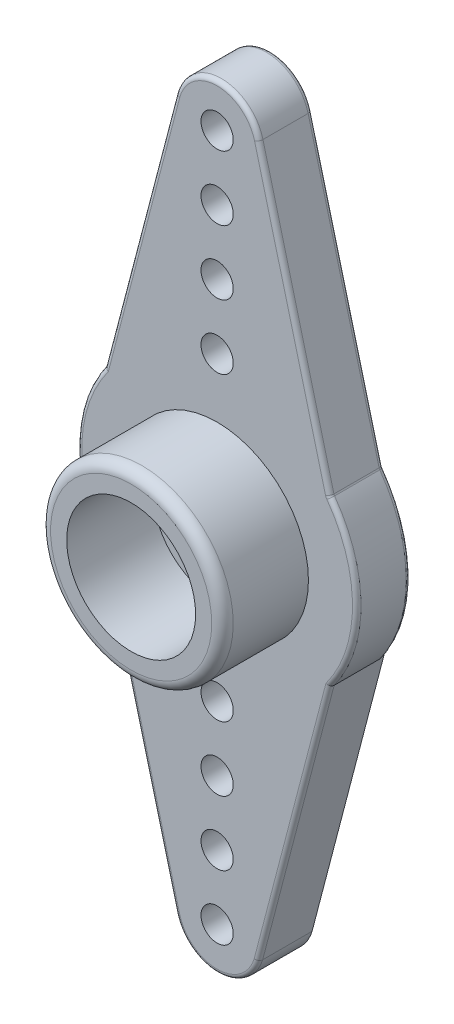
ISO-10303-21;
HEADER;
FILE_DESCRIPTION(('STEP AP214'),'2;1');
FILE_NAME('part.step','',(''),(''),'','','');
FILE_SCHEMA(('AUTOMOTIVE_DESIGN { 1 0 10303 214 1 1 1 1 }'));
ENDSEC;
DATA;
#1=APPLICATION_CONTEXT('core data for automotive mechanical design processes');
#2=APPLICATION_PROTOCOL_DEFINITION('international standard','automotive_design',2000,#1);
#3=PRODUCT_CONTEXT('',#1,'mechanical');
#4=PRODUCT('Part','Part','',(#3));
#5=PRODUCT_RELATED_PRODUCT_CATEGORY('part','',(#4));
#6=PRODUCT_DEFINITION_FORMATION('','',#4);
#7=PRODUCT_DEFINITION_CONTEXT('part definition',#1,'design');
#8=PRODUCT_DEFINITION('design','',#6,#7);
#9=PRODUCT_DEFINITION_SHAPE('','',#8);
#10=(LENGTH_UNIT() NAMED_UNIT(*) SI_UNIT(.MILLI.,.METRE.));
#11=(NAMED_UNIT(*) PLANE_ANGLE_UNIT() SI_UNIT($,.RADIAN.));
#12=(NAMED_UNIT(*) SI_UNIT($,.STERADIAN.) SOLID_ANGLE_UNIT());
#13=UNCERTAINTY_MEASURE_WITH_UNIT(LENGTH_MEASURE(1.E-05),#10,'distance_accuracy_value','');
#14=(GEOMETRIC_REPRESENTATION_CONTEXT(3) GLOBAL_UNCERTAINTY_ASSIGNED_CONTEXT((#13)) GLOBAL_UNIT_ASSIGNED_CONTEXT((#10,
#11,#12)) REPRESENTATION_CONTEXT('',''));
#15=CARTESIAN_POINT('',(0.,0.,0.));
#16=DIRECTION('',(0.,0.,1.));
#17=DIRECTION('',(1.,0.,0.));
#18=AXIS2_PLACEMENT_3D('',#15,#16,#17);
#19=CARTESIAN_POINT('',(0.,0.,0.8));
#20=DIRECTION('',(0.,0.,-1.));
#21=DIRECTION('',(-1.,0.,0.));
#22=AXIS2_PLACEMENT_3D('',#19,#20,#21);
#23=PLANE('',#22);
#24=CARTESIAN_POINT('',(0.,0.,0.8));
#25=DIRECTION('',(0.,0.,-1.));
#26=DIRECTION('',(-1.,0.,0.));
#27=AXIS2_PLACEMENT_3D('',#24,#25,#26);
#28=CIRCLE('',#27,4.5);
#29=CARTESIAN_POINT('',(-4.49999999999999,0.,0.8));
#30=VERTEX_POINT('',#29);
#31=EDGE_CURVE('E208',#30,#30,#28,.T.);
#32=ORIENTED_EDGE('',*,*,#31,.T.);
#33=EDGE_LOOP('',(#32));
#34=FACE_BOUND('',#33,.T.);
#35=CARTESIAN_POINT('',(0.,0.,0.8));
#36=DIRECTION('',(0.,0.,-1.));
#37=DIRECTION('',(-1.,0.,0.));
#38=AXIS2_PLACEMENT_3D('',#35,#36,#37);
#39=CIRCLE('',#38,3.7);
#40=CARTESIAN_POINT('',(-3.7,0.,0.8));
#41=VERTEX_POINT('',#40);
#42=EDGE_CURVE('E435',#41,#41,#39,.T.);
#43=ORIENTED_EDGE('',*,*,#42,.F.);
#44=EDGE_LOOP('',(#43));
#45=FACE_BOUND('',#44,.T.);
#46=ADVANCED_FACE('F35',(#34,#45),#23,.T.);
#47=CARTESIAN_POINT('',(0.,0.,2.5));
#48=DIRECTION('',(0.,0.,-1.));
#49=DIRECTION('',(-1.,0.,0.));
#50=AXIS2_PLACEMENT_3D('',#47,#48,#49);
#51=CYLINDRICAL_SURFACE('',#50,1.5);
#52=CARTESIAN_POINT('',(0.,0.,2.5));
#53=DIRECTION('',(0.,0.,1.));
#54=DIRECTION('',(1.,0.,0.));
#55=AXIS2_PLACEMENT_3D('',#52,#53,#54);
#56=CIRCLE('',#55,1.5);
#57=CARTESIAN_POINT('',(1.50000000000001,0.,2.5));
#58=VERTEX_POINT('',#57);
#59=EDGE_CURVE('E477',#58,#58,#56,.T.);
#60=ORIENTED_EDGE('',*,*,#59,.T.);
#61=EDGE_LOOP('',(#60));
#62=FACE_BOUND('',#61,.T.);
#63=CARTESIAN_POINT('',(0.,0.,0.8));
#64=DIRECTION('',(0.,0.,-1.));
#65=DIRECTION('',(-1.,0.,0.));
#66=AXIS2_PLACEMENT_3D('',#63,#64,#65);
#67=CIRCLE('',#66,1.5);
#68=CARTESIAN_POINT('',(-1.49999999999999,0.,0.8));
#69=VERTEX_POINT('',#68);
#70=EDGE_CURVE('E204',#69,#69,#67,.T.);
#71=ORIENTED_EDGE('',*,*,#70,.T.);
#72=EDGE_LOOP('',(#71));
#73=FACE_BOUND('',#72,.T.);
#74=ADVANCED_FACE('F519',(#62,#73),#51,.F.);
#75=CARTESIAN_POINT('',(0.,0.,2.5));
#76=DIRECTION('',(0.,0.,1.));
#77=DIRECTION('',(1.,0.,0.));
#78=AXIS2_PLACEMENT_3D('',#75,#76,#77);
#79=PLANE('',#78);
#80=CARTESIAN_POINT('',(0.,15.9999999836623,2.5));
#81=DIRECTION('',(0.,0.,1.));
#82=DIRECTION('',(1.,0.,0.));
#83=AXIS2_PLACEMENT_3D('',#80,#81,#82);
#84=CIRCLE('',#83,1.79999999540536);
#85=CARTESIAN_POINT('',(1.74147494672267,16.4552636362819,2.5));
#86=VERTEX_POINT('',#85);
#87=CARTESIAN_POINT('',(-1.74147494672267,16.4552636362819,2.5));
#88=VERTEX_POINT('',#87);
#89=EDGE_CURVE('E233',#86,#88,#84,.T.);
#90=ORIENTED_EDGE('',*,*,#89,.T.);
#91=DIRECTION('',(-0.252924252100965,-0.967486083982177,0.));
#92=VECTOR('',#91,1.);
#93=CARTESIAN_POINT('',(-5.0535608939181,3.78586939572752,2.5));
#94=LINE('',#93,#92);
#95=CARTESIAN_POINT('',(-5.06325278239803,3.74879597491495,2.5));
#96=VERTEX_POINT('',#95);
#97=EDGE_CURVE('E235',#88,#96,#94,.T.);
#98=ORIENTED_EDGE('',*,*,#97,.T.);
#99=CARTESIAN_POINT('',(0.,0.,2.5));
#100=DIRECTION('',(0.,0.,1.));
#101=DIRECTION('',(1.,0.,0.));
#102=AXIS2_PLACEMENT_3D('',#99,#100,#101);
#103=CIRCLE('',#102,6.3);
#104=CARTESIAN_POINT('',(-5.06293609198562,-3.74922367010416,2.5));
#105=VERTEX_POINT('',#104);
#106=EDGE_CURVE('E229',#96,#105,#103,.T.);
#107=ORIENTED_EDGE('',*,*,#106,.T.);
#108=DIRECTION('',(0.252973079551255,-0.967473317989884,0.));
#109=VECTOR('',#108,1.);
#110=CARTESIAN_POINT('',(-1.72577439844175,-16.5119053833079,2.5));
#111=LINE('',#110,#109);
#112=CARTESIAN_POINT('',(-1.72653633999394,-16.5089914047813,2.5));
#113=VERTEX_POINT('',#112);
#114=EDGE_CURVE('E224',#105,#113,#111,.T.);
#115=ORIENTED_EDGE('',*,*,#114,.T.);
#116=CARTESIAN_POINT('',(-6.36749128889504E-13,-15.9999999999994,2.5));
#117=DIRECTION('',(0.,0.,1.));
#118=DIRECTION('',(1.,0.,0.));
#119=AXIS2_PLACEMENT_3D('',#116,#117,#118);
#120=CIRCLE('',#119,1.79999999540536);
#121=CARTESIAN_POINT('',(1.72653633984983,-16.5089914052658,2.5));
#122=VERTEX_POINT('',#121);
#123=EDGE_CURVE('E219',#113,#122,#120,.T.);
#124=ORIENTED_EDGE('',*,*,#123,.T.);
#125=DIRECTION('',(0.252973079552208,0.967473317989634,0.));
#126=VECTOR('',#125,1.);
#127=CARTESIAN_POINT('',(5.05324144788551,-3.78629998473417,2.5));
#128=LINE('',#127,#126);
#129=CARTESIAN_POINT('',(5.06293609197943,-3.74922367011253,2.5));
#130=VERTEX_POINT('',#129);
#131=EDGE_CURVE('E217',#122,#130,#128,.T.);
#132=ORIENTED_EDGE('',*,*,#131,.T.);
#133=CARTESIAN_POINT('',(0.,0.,2.5));
#134=DIRECTION('',(0.,0.,1.));
#135=DIRECTION('',(1.,0.,0.));
#136=AXIS2_PLACEMENT_3D('',#133,#134,#135);
#137=CIRCLE('',#136,6.3);
#138=CARTESIAN_POINT('',(5.10677693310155,3.68928575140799,2.5));
#139=VERTEX_POINT('',#138);
#140=EDGE_CURVE('E221',#130,#139,#137,.T.);
#141=ORIENTED_EDGE('',*,*,#140,.T.);
#142=CARTESIAN_POINT('',(5.43101673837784,3.92352611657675,2.5));
#143=DIRECTION('',(0.,0.,1.));
#144=DIRECTION('',(1.,0.,0.));
#145=AXIS2_PLACEMENT_3D('',#142,#143,#144);
#146=CIRCLE('',#145,0.4);
#147=CARTESIAN_POINT('',(5.04402230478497,3.82235641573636,2.5));
#148=VERTEX_POINT('',#147);
#149=EDGE_CURVE('E226',#148,#139,#146,.T.);
#150=ORIENTED_EDGE('',*,*,#149,.F.);
#151=DIRECTION('',(-0.252924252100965,0.967486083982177,0.));
#152=VECTOR('',#151,1.);
#153=CARTESIAN_POINT('',(1.74147494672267,16.4552636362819,2.5));
#154=LINE('',#153,#152);
#155=EDGE_CURVE('E231',#148,#86,#154,.T.);
#156=ORIENTED_EDGE('',*,*,#155,.T.);
#157=EDGE_LOOP('',(#90,#98,#107,#115,#124,#132,#141,#150,#156));
#158=FACE_BOUND('',#157,.T.);
#159=CARTESIAN_POINT('',(2.5999122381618E-12,-13.,2.5));
#160=DIRECTION('',(0.,0.,1.));
#161=DIRECTION('',(1.,0.,0.));
#162=AXIS2_PLACEMENT_3D('',#159,#160,#161);
#163=CIRCLE('',#162,0.750000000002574);
#164=CARTESIAN_POINT('',(0.750000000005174,-13.,2.5));
#165=VERTEX_POINT('',#164);
#166=EDGE_CURVE('E462',#165,#165,#163,.T.);
#167=ORIENTED_EDGE('',*,*,#166,.F.);
#168=EDGE_LOOP('',(#167));
#169=FACE_BOUND('',#168,.T.);
#170=CARTESIAN_POINT('',(2.59844266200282E-12,-7.,2.5));
#171=DIRECTION('',(0.,0.,1.));
#172=DIRECTION('',(1.,0.,0.));
#173=AXIS2_PLACEMENT_3D('',#170,#171,#172);
#174=CIRCLE('',#173,0.750000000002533);
#175=CARTESIAN_POINT('',(0.750000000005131,-7.,2.5));
#176=VERTEX_POINT('',#175);
#177=EDGE_CURVE('E474',#176,#176,#174,.T.);
#178=ORIENTED_EDGE('',*,*,#177,.F.);
#179=EDGE_LOOP('',(#178));
#180=FACE_BOUND('',#179,.T.);
#181=CARTESIAN_POINT('',(0.,16.,2.5));
#182=DIRECTION('',(0.,0.,1.));
#183=DIRECTION('',(1.,0.,0.));
#184=AXIS2_PLACEMENT_3D('',#181,#182,#183);
#185=CIRCLE('',#184,0.75);
#186=CARTESIAN_POINT('',(0.750000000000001,16.,2.5));
#187=VERTEX_POINT('',#186);
#188=EDGE_CURVE('E483',#187,#187,#185,.T.);
#189=ORIENTED_EDGE('',*,*,#188,.F.);
#190=EDGE_LOOP('',(#189));
#191=FACE_BOUND('',#190,.T.);
#192=CARTESIAN_POINT('',(0.,10.,2.5));
#193=DIRECTION('',(0.,0.,1.));
#194=DIRECTION('',(1.,0.,0.));
#195=AXIS2_PLACEMENT_3D('',#192,#193,#194);
#196=CIRCLE('',#195,0.750000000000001);
#197=CARTESIAN_POINT('',(0.750000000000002,10.,2.5));
#198=VERTEX_POINT('',#197);
#199=EDGE_CURVE('E495',#198,#198,#196,.T.);
#200=ORIENTED_EDGE('',*,*,#199,.F.);
#201=EDGE_LOOP('',(#200));
#202=FACE_BOUND('',#201,.T.);
#203=CARTESIAN_POINT('',(0.,7.,2.5));
#204=DIRECTION('',(0.,0.,1.));
#205=DIRECTION('',(1.,0.,0.));
#206=AXIS2_PLACEMENT_3D('',#203,#204,#205);
#207=CIRCLE('',#206,0.75);
#208=CARTESIAN_POINT('',(0.750000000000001,7.,2.5));
#209=VERTEX_POINT('',#208);
#210=EDGE_CURVE('E177',#209,#209,#207,.T.);
#211=ORIENTED_EDGE('',*,*,#210,.F.);
#212=EDGE_LOOP('',(#211));
#213=FACE_BOUND('',#212,.T.);
#214=CARTESIAN_POINT('',(0.,13.,2.5));
#215=DIRECTION('',(0.,0.,1.));
#216=DIRECTION('',(1.,0.,0.));
#217=AXIS2_PLACEMENT_3D('',#214,#215,#216);
#218=CIRCLE('',#217,0.750000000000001);
#219=CARTESIAN_POINT('',(0.750000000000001,13.,2.5));
#220=VERTEX_POINT('',#219);
#221=EDGE_CURVE('E489',#220,#220,#218,.T.);
#222=ORIENTED_EDGE('',*,*,#221,.F.);
#223=EDGE_LOOP('',(#222));
#224=FACE_BOUND('',#223,.T.);
#225=CARTESIAN_POINT('',(2.59917745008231E-12,-10.,2.5));
#226=DIRECTION('',(0.,0.,1.));
#227=DIRECTION('',(1.,0.,0.));
#228=AXIS2_PLACEMENT_3D('',#225,#226,#227);
#229=CIRCLE('',#228,0.750000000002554);
#230=CARTESIAN_POINT('',(0.750000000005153,-10.,2.5));
#231=VERTEX_POINT('',#230);
#232=EDGE_CURVE('E468',#231,#231,#229,.T.);
#233=ORIENTED_EDGE('',*,*,#232,.F.);
#234=EDGE_LOOP('',(#233));
#235=FACE_BOUND('',#234,.T.);
#236=CARTESIAN_POINT('',(2.60064702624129E-12,-16.,2.5));
#237=DIRECTION('',(0.,0.,1.));
#238=DIRECTION('',(1.,0.,0.));
#239=AXIS2_PLACEMENT_3D('',#236,#237,#238);
#240=CIRCLE('',#239,0.750000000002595);
#241=CARTESIAN_POINT('',(0.750000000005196,-16.,2.5));
#242=VERTEX_POINT('',#241);
#243=EDGE_CURVE('E456',#242,#242,#240,.T.);
#244=ORIENTED_EDGE('',*,*,#243,.F.);
#245=EDGE_LOOP('',(#244));
#246=FACE_BOUND('',#245,.T.);
#247=CARTESIAN_POINT('',(0.,0.,2.5));
#248=DIRECTION('',(0.,0.,1.));
#249=DIRECTION('',(1.,0.,0.));
#250=AXIS2_PLACEMENT_3D('',#247,#248,#249);
#251=CIRCLE('',#250,4.25);
#252=CARTESIAN_POINT('',(4.25,0.,2.5));
#253=VERTEX_POINT('',#252);
#254=EDGE_CURVE('E452',#253,#253,#251,.T.);
#255=ORIENTED_EDGE('',*,*,#254,.F.);
#256=EDGE_LOOP('',(#255));
#257=FACE_BOUND('',#256,.T.);
#258=ADVANCED_FACE('F396',(#158,#169,#180,#191,#202,#213,#224,#235,#246,#257),#79,.T.);
#259=CARTESIAN_POINT('',(0.,0.,2.5));
#260=DIRECTION('',(0.,0.,1.));
#261=DIRECTION('',(1.,0.,0.));
#262=AXIS2_PLACEMENT_3D('',#259,#260,#261);
#263=CIRCLE('',#262,3.);
#264=CARTESIAN_POINT('',(3.,0.,2.5));
#265=VERTEX_POINT('',#264);
#266=EDGE_CURVE('E161',#265,#265,#263,.F.);
#267=ORIENTED_EDGE('',*,*,#266,.F.);
#268=EDGE_LOOP('',(#267));
#269=FACE_BOUND('',#268,.T.);
#270=ORIENTED_EDGE('',*,*,#59,.F.);
#271=EDGE_LOOP('',(#270));
#272=FACE_BOUND('',#271,.T.);
#273=ADVANCED_FACE('F607',(#269,#272),#79,.T.);
#274=CARTESIAN_POINT('',(0.,0.,0.));
#275=DIRECTION('',(0.,0.,1.));
#276=DIRECTION('',(1.,0.,0.));
#277=AXIS2_PLACEMENT_3D('',#274,#275,#276);
#278=PLANE('',#277);
#279=CARTESIAN_POINT('',(0.,0.,0.));
#280=DIRECTION('',(0.,0.,-1.));
#281=DIRECTION('',(-1.,0.,0.));
#282=AXIS2_PLACEMENT_3D('',#279,#280,#281);
#283=CIRCLE('',#282,4.5);
#284=CARTESIAN_POINT('',(-4.49999999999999,0.,0.));
#285=VERTEX_POINT('',#284);
#286=EDGE_CURVE('E444',#285,#285,#283,.T.);
#287=ORIENTED_EDGE('',*,*,#286,.F.);
#288=EDGE_LOOP('',(#287));
#289=FACE_BOUND('',#288,.T.);
#290=CARTESIAN_POINT('',(2.5999122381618E-12,-13.,0.));
#291=DIRECTION('',(0.,0.,1.));
#292=DIRECTION('',(1.,0.,0.));
#293=AXIS2_PLACEMENT_3D('',#290,#291,#292);
#294=CIRCLE('',#293,0.750000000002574);
#295=CARTESIAN_POINT('',(0.750000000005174,-13.,0.));
#296=VERTEX_POINT('',#295);
#297=EDGE_CURVE('E459',#296,#296,#294,.T.);
#298=ORIENTED_EDGE('',*,*,#297,.T.);
#299=EDGE_LOOP('',(#298));
#300=FACE_BOUND('',#299,.T.);
#301=CARTESIAN_POINT('',(2.59844266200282E-12,-7.,0.));
#302=DIRECTION('',(0.,0.,1.));
#303=DIRECTION('',(1.,0.,0.));
#304=AXIS2_PLACEMENT_3D('',#301,#302,#303);
#305=CIRCLE('',#304,0.750000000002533);
#306=CARTESIAN_POINT('',(0.750000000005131,-7.,0.));
#307=VERTEX_POINT('',#306);
#308=EDGE_CURVE('E471',#307,#307,#305,.T.);
#309=ORIENTED_EDGE('',*,*,#308,.T.);
#310=EDGE_LOOP('',(#309));
#311=FACE_BOUND('',#310,.T.);
#312=CARTESIAN_POINT('',(0.,16.,0.));
#313=DIRECTION('',(0.,0.,1.));
#314=DIRECTION('',(1.,0.,0.));
#315=AXIS2_PLACEMENT_3D('',#312,#313,#314);
#316=CIRCLE('',#315,0.75);
#317=CARTESIAN_POINT('',(0.750000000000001,16.,0.));
#318=VERTEX_POINT('',#317);
#319=EDGE_CURVE('E482',#318,#318,#316,.T.);
#320=ORIENTED_EDGE('',*,*,#319,.T.);
#321=EDGE_LOOP('',(#320));
#322=FACE_BOUND('',#321,.T.);
#323=CARTESIAN_POINT('',(0.,10.,0.));
#324=DIRECTION('',(0.,0.,1.));
#325=DIRECTION('',(1.,0.,0.));
#326=AXIS2_PLACEMENT_3D('',#323,#324,#325);
#327=CIRCLE('',#326,0.750000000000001);
#328=CARTESIAN_POINT('',(0.750000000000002,10.,0.));
#329=VERTEX_POINT('',#328);
#330=EDGE_CURVE('E492',#329,#329,#327,.T.);
#331=ORIENTED_EDGE('',*,*,#330,.T.);
#332=EDGE_LOOP('',(#331));
#333=FACE_BOUND('',#332,.T.);
#334=CARTESIAN_POINT('',(0.,0.,0.));
#335=DIRECTION('',(0.,0.,1.));
#336=DIRECTION('',(1.,0.,0.));
#337=AXIS2_PLACEMENT_3D('',#334,#335,#336);
#338=CIRCLE('',#337,6.3);
#339=CARTESIAN_POINT('',(5.10677693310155,3.68928575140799,0.));
#340=VERTEX_POINT('',#339);
#341=CARTESIAN_POINT('',(5.40266549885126,-3.24055635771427,0.));
#342=VERTEX_POINT('',#341);
#343=EDGE_CURVE('E253',#340,#342,#338,.F.);
#344=ORIENTED_EDGE('',*,*,#343,.T.);
#345=DIRECTION('',(0.252973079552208,0.967473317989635,0.));
#346=VECTOR('',#345,1.);
#347=CARTESIAN_POINT('',(1.91926906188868,-16.5624999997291,0.));
#348=LINE('',#347,#346);
#349=CARTESIAN_POINT('',(1.91926906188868,-16.5624999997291,0.));
#350=VERTEX_POINT('',#349);
#351=EDGE_CURVE('E185',#350,#342,#348,.T.);
#352=ORIENTED_EDGE('',*,*,#351,.F.);
#353=CARTESIAN_POINT('',(-6.36749128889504E-13,-15.9999999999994,0.));
#354=DIRECTION('',(0.,0.,1.));
#355=DIRECTION('',(1.,0.,0.));
#356=AXIS2_PLACEMENT_3D('',#353,#354,#355);
#357=CIRCLE('',#356,1.99999999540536);
#358=CARTESIAN_POINT('',(-1.91926906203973,-16.5624999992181,0.));
#359=VERTEX_POINT('',#358);
#360=EDGE_CURVE('E171',#359,#350,#357,.T.);
#361=ORIENTED_EDGE('',*,*,#360,.F.);
#362=DIRECTION('',(0.252973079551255,-0.967473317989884,0.));
#363=VECTOR('',#362,1.);
#364=CARTESIAN_POINT('',(-1.91926906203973,-16.5624999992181,0.));
#365=LINE('',#364,#363);
#366=CARTESIAN_POINT('',(-5.24673611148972,-3.836894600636,0.));
#367=VERTEX_POINT('',#366);
#368=EDGE_CURVE('E156',#367,#359,#365,.T.);
#369=ORIENTED_EDGE('',*,*,#368,.F.);
#370=CARTESIAN_POINT('',(0.,0.,0.));
#371=DIRECTION('',(0.,0.,1.));
#372=DIRECTION('',(1.,0.,0.));
#373=AXIS2_PLACEMENT_3D('',#370,#371,#372);
#374=CIRCLE('',#373,6.5);
#375=CARTESIAN_POINT('',(-4.93840478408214,4.22636465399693,0.));
#376=VERTEX_POINT('',#375);
#377=EDGE_CURVE('E168',#376,#367,#374,.T.);
#378=ORIENTED_EDGE('',*,*,#377,.F.);
#379=DIRECTION('',(-0.252924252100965,-0.967486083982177,0.));
#380=VECTOR('',#379,1.);
#381=CARTESIAN_POINT('',(-5.65668605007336,1.47879448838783,0.));
#382=LINE('',#381,#380);
#383=CARTESIAN_POINT('',(-1.74147494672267,16.4552636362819,0.));
#384=VERTEX_POINT('',#383);
#385=EDGE_CURVE('E251',#376,#384,#382,.F.);
#386=ORIENTED_EDGE('',*,*,#385,.T.);
#387=CARTESIAN_POINT('',(0.,15.9999999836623,0.));
#388=DIRECTION('',(0.,0.,1.));
#389=DIRECTION('',(1.,0.,0.));
#390=AXIS2_PLACEMENT_3D('',#387,#388,#389);
#391=CIRCLE('',#390,1.79999999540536);
#392=CARTESIAN_POINT('',(1.74147494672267,16.4552636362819,0.));
#393=VERTEX_POINT('',#392);
#394=EDGE_CURVE('E249',#384,#393,#391,.F.);
#395=ORIENTED_EDGE('',*,*,#394,.T.);
#396=DIRECTION('',(-0.252924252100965,0.967486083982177,0.));
#397=VECTOR('',#396,1.);
#398=CARTESIAN_POINT('',(5.65668605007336,1.47879448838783,0.));
#399=LINE('',#398,#397);
#400=CARTESIAN_POINT('',(5.04402230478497,3.82235641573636,0.));
#401=VERTEX_POINT('',#400);
#402=EDGE_CURVE('E247',#393,#401,#399,.F.);
#403=ORIENTED_EDGE('',*,*,#402,.T.);
#404=CARTESIAN_POINT('',(5.43101673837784,3.92352611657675,0.));
#405=DIRECTION('',(0.,0.,1.));
#406=DIRECTION('',(1.,0.,0.));
#407=AXIS2_PLACEMENT_3D('',#404,#405,#406);
#408=CIRCLE('',#407,0.4);
#409=EDGE_CURVE('E244',#340,#401,#408,.F.);
#410=ORIENTED_EDGE('',*,*,#409,.F.);
#411=EDGE_LOOP('',(#344,#352,#361,#369,#378,#386,#395,#403,#410));
#412=FACE_BOUND('',#411,.T.);
#413=CARTESIAN_POINT('',(0.,7.,0.));
#414=DIRECTION('',(0.,0.,1.));
#415=DIRECTION('',(1.,0.,0.));
#416=AXIS2_PLACEMENT_3D('',#413,#414,#415);
#417=CIRCLE('',#416,0.75);
#418=CARTESIAN_POINT('',(0.750000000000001,7.,0.));
#419=VERTEX_POINT('',#418);
#420=EDGE_CURVE('E180',#419,#419,#417,.T.);
#421=ORIENTED_EDGE('',*,*,#420,.T.);
#422=EDGE_LOOP('',(#421));
#423=FACE_BOUND('',#422,.T.);
#424=CARTESIAN_POINT('',(0.,13.,0.));
#425=DIRECTION('',(0.,0.,1.));
#426=DIRECTION('',(1.,0.,0.));
#427=AXIS2_PLACEMENT_3D('',#424,#425,#426);
#428=CIRCLE('',#427,0.750000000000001);
#429=CARTESIAN_POINT('',(0.750000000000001,13.,0.));
#430=VERTEX_POINT('',#429);
#431=EDGE_CURVE('E486',#430,#430,#428,.T.);
#432=ORIENTED_EDGE('',*,*,#431,.T.);
#433=EDGE_LOOP('',(#432));
#434=FACE_BOUND('',#433,.T.);
#435=CARTESIAN_POINT('',(2.59917745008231E-12,-10.,0.));
#436=DIRECTION('',(0.,0.,1.));
#437=DIRECTION('',(1.,0.,0.));
#438=AXIS2_PLACEMENT_3D('',#435,#436,#437);
#439=CIRCLE('',#438,0.750000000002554);
#440=CARTESIAN_POINT('',(0.750000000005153,-10.,0.));
#441=VERTEX_POINT('',#440);
#442=EDGE_CURVE('E465',#441,#441,#439,.T.);
#443=ORIENTED_EDGE('',*,*,#442,.T.);
#444=EDGE_LOOP('',(#443));
#445=FACE_BOUND('',#444,.T.);
#446=CARTESIAN_POINT('',(2.60064702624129E-12,-16.,0.));
#447=DIRECTION('',(0.,0.,1.));
#448=DIRECTION('',(1.,0.,0.));
#449=AXIS2_PLACEMENT_3D('',#446,#447,#448);
#450=CIRCLE('',#449,0.750000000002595);
#451=CARTESIAN_POINT('',(0.750000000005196,-16.,0.));
#452=VERTEX_POINT('',#451);
#453=EDGE_CURVE('E455',#452,#452,#450,.T.);
#454=ORIENTED_EDGE('',*,*,#453,.T.);
#455=EDGE_LOOP('',(#454));
#456=FACE_BOUND('',#455,.T.);
#457=ADVANCED_FACE('F166',(#289,#300,#311,#322,#333,#412,#423,#434,#445,#456),#278,.F.);
#458=CARTESIAN_POINT('',(0.,0.,2.5));
#459=DIRECTION('',(0.,0.,-1.));
#460=DIRECTION('',(-1.,0.,0.));
#461=AXIS2_PLACEMENT_3D('',#458,#459,#460);
#462=CYLINDRICAL_SURFACE('',#461,6.5);
#463=DIRECTION('',(0.,0.,-1.));
#464=VECTOR('',#463,1.);
#465=CARTESIAN_POINT('',(-5.24673611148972,-3.836894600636,2.5));
#466=LINE('',#465,#464);
#467=CARTESIAN_POINT('',(-5.24673611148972,-3.836894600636,2.3));
#468=VERTEX_POINT('',#467);
#469=EDGE_CURVE('E153',#468,#367,#466,.T.);
#470=ORIENTED_EDGE('',*,*,#469,.F.);
#471=CARTESIAN_POINT('',(0.,0.,2.3));
#472=DIRECTION('',(0.,0.,1.));
#473=DIRECTION('',(1.,0.,0.));
#474=AXIS2_PLACEMENT_3D('',#471,#472,#473);
#475=CIRCLE('',#474,6.5);
#476=CARTESIAN_POINT('',(-5.24705811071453,3.83645424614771,2.3));
#477=VERTEX_POINT('',#476);
#478=EDGE_CURVE('E271',#468,#477,#475,.F.);
#479=ORIENTED_EDGE('',*,*,#478,.T.);
#480=DIRECTION('',(0.,0.,-1.));
#481=VECTOR('',#480,1.);
#482=CARTESIAN_POINT('',(-5.24705811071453,3.83645424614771,2.5));
#483=LINE('',#482,#481);
#484=CARTESIAN_POINT('',(-5.24705811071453,3.83645424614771,0.2));
#485=VERTEX_POINT('',#484);
#486=EDGE_CURVE('E187',#477,#485,#483,.T.);
#487=ORIENTED_EDGE('',*,*,#486,.T.);
#488=CARTESIAN_POINT('',(-5.24705811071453,3.83645424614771,0.2));
#489=CARTESIAN_POINT('',(-5.24706642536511,3.83644263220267,0.19531118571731));
#490=CARTESIAN_POINT('',(-5.24679324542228,3.83681651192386,0.190642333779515));
#491=CARTESIAN_POINT('',(-5.24576305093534,3.83822500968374,0.181521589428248));
#492=CARTESIAN_POINT('',(-5.2450125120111,3.83925078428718,0.177067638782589));
#493=CARTESIAN_POINT('',(-5.24285436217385,3.84219754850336,0.167297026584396));
#494=CARTESIAN_POINT('',(-5.24132650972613,3.84428214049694,0.162057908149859));
#495=CARTESIAN_POINT('',(-5.2377913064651,3.84909746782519,0.152038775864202));
#496=CARTESIAN_POINT('',(-5.23578128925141,3.85183179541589,0.147261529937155));
#497=CARTESIAN_POINT('',(-5.22988186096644,3.85984124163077,0.134940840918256));
#498=CARTESIAN_POINT('',(-5.22566983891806,3.86554399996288,0.127835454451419));
#499=CARTESIAN_POINT('',(-5.21668227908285,3.87766478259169,0.114693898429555));
#500=CARTESIAN_POINT('',(-5.21190552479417,3.8840843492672,0.108660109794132));
#501=CARTESIAN_POINT('',(-5.1960668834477,3.90528044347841,0.090669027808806));
#502=CARTESIAN_POINT('',(-5.18432891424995,3.92085809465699,0.0802716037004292));
#503=CARTESIAN_POINT('',(-5.15998889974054,3.95283792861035,0.0619455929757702));
#504=CARTESIAN_POINT('',(-5.14738174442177,3.96924480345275,0.0540334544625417));
#505=CARTESIAN_POINT('',(-5.11894159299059,4.00588048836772,0.0386510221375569));
#506=CARTESIAN_POINT('',(-5.10298318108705,4.02619425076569,0.0316151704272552));
#507=CARTESIAN_POINT('',(-5.07049138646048,4.06703843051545,0.0197486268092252));
#508=CARTESIAN_POINT('',(-5.05395707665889,4.08756915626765,0.0149216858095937));
#509=CARTESIAN_POINT('',(-5.02105714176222,4.12790949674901,0.00739977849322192));
#510=CARTESIAN_POINT('',(-5.00470679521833,4.14771852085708,0.00463445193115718));
#511=CARTESIAN_POINT('',(-4.97174422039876,4.18717350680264,0.000948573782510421));
#512=CARTESIAN_POINT('',(-4.95513309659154,4.20681979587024,2.16596401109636E-05));
#513=CARTESIAN_POINT('',(-4.93840478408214,4.22636465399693,0.));
#514=B_SPLINE_CURVE_WITH_KNOTS('',3,(#488,#489,#490,#491,#492,#493,#494,#495,#496,#497,#498,
#499,#500,#501,#502,#503,#504,#505,#506,#507,#508,#509,#510,#511,#512,#513),.UNSPECIFIED.,.F.,
.F.,(4,2,2,2,2,2,2,2,2,2,2,2,4),(0.,0.0140115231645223,0.0278369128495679,0.0452641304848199,
0.062790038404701,0.0927324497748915,0.122740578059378,0.188686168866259,0.255059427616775,
0.335242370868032,0.415560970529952,0.492994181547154,0.570158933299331),.UNSPECIFIED.);
#515=EDGE_CURVE('E11',#485,#376,#514,.T.);
#516=ORIENTED_EDGE('',*,*,#515,.T.);
#517=ORIENTED_EDGE('',*,*,#377,.T.);
#518=EDGE_LOOP('',(#470,#479,#487,#516,#517));
#519=FACE_BOUND('',#518,.T.);
#520=ADVANCED_FACE('F173',(#519),#462,.T.);
#521=CARTESIAN_POINT('',(-1.91926906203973,-16.5624999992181,2.5));
#522=DIRECTION('',(0.967473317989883,0.252973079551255,0.));
#523=DIRECTION('',(-0.252973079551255,0.967473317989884,0.));
#524=AXIS2_PLACEMENT_3D('',#521,#522,#523);
#525=PLANE('',#524);
#526=DIRECTION('',(0.,0.,-1.));
#527=VECTOR('',#526,1.);
#528=CARTESIAN_POINT('',(-1.91926906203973,-16.5624999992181,2.5));
#529=LINE('',#528,#527);
#530=CARTESIAN_POINT('',(-1.91926906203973,-16.5624999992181,2.3));
#531=VERTEX_POINT('',#530);
#532=EDGE_CURVE('E162',#531,#359,#529,.T.);
#533=ORIENTED_EDGE('',*,*,#532,.F.);
#534=DIRECTION('',(0.252973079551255,-0.967473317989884,0.));
#535=VECTOR('',#534,1.);
#536=CARTESIAN_POINT('',(-5.24673611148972,-3.836894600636,2.3));
#537=LINE('',#536,#535);
#538=EDGE_CURVE('E53',#531,#468,#537,.F.);
#539=ORIENTED_EDGE('',*,*,#538,.T.);
#540=ORIENTED_EDGE('',*,*,#469,.T.);
#541=ORIENTED_EDGE('',*,*,#368,.T.);
#542=EDGE_LOOP('',(#533,#539,#540,#541));
#543=FACE_BOUND('',#542,.T.);
#544=ADVANCED_FACE('F155',(#543),#525,.F.);
#545=CARTESIAN_POINT('',(-6.36749128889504E-13,-15.9999999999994,2.5));
#546=DIRECTION('',(0.,0.,-1.));
#547=DIRECTION('',(-1.,0.,0.));
#548=AXIS2_PLACEMENT_3D('',#545,#546,#547);
#549=CYLINDRICAL_SURFACE('',#548,1.99999999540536);
#550=DIRECTION('',(0.,0.,-1.));
#551=VECTOR('',#550,1.);
#552=CARTESIAN_POINT('',(1.91926906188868,-16.5624999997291,2.5));
#553=LINE('',#552,#551);
#554=CARTESIAN_POINT('',(1.91926906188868,-16.5624999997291,2.3));
#555=VERTEX_POINT('',#554);
#556=EDGE_CURVE('E198',#555,#350,#553,.T.);
#557=ORIENTED_EDGE('',*,*,#556,.F.);
#558=CARTESIAN_POINT('',(-6.36749128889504E-13,-15.9999999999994,2.3));
#559=DIRECTION('',(0.,0.,1.));
#560=DIRECTION('',(1.,0.,0.));
#561=AXIS2_PLACEMENT_3D('',#558,#559,#560);
#562=CIRCLE('',#561,1.99999999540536);
#563=EDGE_CURVE('E61',#555,#531,#562,.F.);
#564=ORIENTED_EDGE('',*,*,#563,.T.);
#565=ORIENTED_EDGE('',*,*,#532,.T.);
#566=ORIENTED_EDGE('',*,*,#360,.T.);
#567=EDGE_LOOP('',(#557,#564,#565,#566));
#568=FACE_BOUND('',#567,.T.);
#569=ADVANCED_FACE('F717',(#568),#549,.T.);
#570=CARTESIAN_POINT('',(1.91926906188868,-16.5624999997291,2.5));
#571=DIRECTION('',(-0.967473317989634,0.252973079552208,0.));
#572=DIRECTION('',(-0.252973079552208,-0.967473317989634,0.));
#573=AXIS2_PLACEMENT_3D('',#570,#571,#572);
#574=PLANE('',#573);
#575=DIRECTION('',(0.,0.,-1.));
#576=VECTOR('',#575,1.);
#577=CARTESIAN_POINT('',(5.24673611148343,-3.83689460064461,2.5));
#578=LINE('',#577,#576);
#579=CARTESIAN_POINT('',(5.24673611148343,-3.83689460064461,2.3));
#580=VERTEX_POINT('',#579);
#581=CARTESIAN_POINT('',(5.24673611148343,-3.83689460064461,0.2));
#582=VERTEX_POINT('',#581);
#583=EDGE_CURVE('E195',#580,#582,#578,.T.);
#584=ORIENTED_EDGE('',*,*,#583,.F.);
#585=DIRECTION('',(0.252973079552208,0.967473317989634,0.));
#586=VECTOR('',#585,1.);
#587=CARTESIAN_POINT('',(1.91926906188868,-16.5624999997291,2.3));
#588=LINE('',#587,#586);
#589=EDGE_CURVE('E273',#580,#555,#588,.F.);
#590=ORIENTED_EDGE('',*,*,#589,.T.);
#591=ORIENTED_EDGE('',*,*,#556,.T.);
#592=ORIENTED_EDGE('',*,*,#351,.T.);
#593=CARTESIAN_POINT('',(5.40266549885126,-3.24055635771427,0.));
#594=CARTESIAN_POINT('',(5.39420398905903,-3.27291665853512,2.3086555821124E-05));
#595=CARTESIAN_POINT('',(5.38573770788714,-3.30529520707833,0.000664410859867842));
#596=CARTESIAN_POINT('',(5.3687805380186,-3.37014641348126,0.0035410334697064));
#597=CARTESIAN_POINT('',(5.36028973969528,-3.40261872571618,0.00578433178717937));
#598=CARTESIAN_POINT('',(5.34333207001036,-3.46747184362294,0.0122376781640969));
#599=CARTESIAN_POINT('',(5.33486531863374,-3.49985219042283,0.0164528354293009));
#600=CARTESIAN_POINT('',(5.31804949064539,-3.56416284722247,0.0274581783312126));
#601=CARTESIAN_POINT('',(5.30970019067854,-3.59609401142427,0.0342425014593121));
#602=CARTESIAN_POINT('',(5.29799110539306,-3.64087437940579,0.0465590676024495));
#603=CARTESIAN_POINT('',(5.29452846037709,-3.65411696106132,0.0505602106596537));
#604=CARTESIAN_POINT('',(5.28766124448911,-3.68038002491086,0.0594064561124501));
#605=CARTESIAN_POINT('',(5.28425685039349,-3.6933998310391,0.0642537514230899));
#606=CARTESIAN_POINT('',(5.27706046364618,-3.72092177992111,0.0757914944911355));
#607=CARTESIAN_POINT('',(5.27328535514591,-3.73535935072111,0.082648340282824));
#608=CARTESIAN_POINT('',(5.26599726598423,-3.76323200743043,0.0982518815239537));
#609=CARTESIAN_POINT('',(5.26248304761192,-3.77667182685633,0.106988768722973));
#610=CARTESIAN_POINT('',(5.25797958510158,-3.79389492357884,0.121086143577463));
#611=CARTESIAN_POINT('',(5.25675559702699,-3.79857595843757,0.125264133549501));
#612=CARTESIAN_POINT('',(5.25442757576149,-3.80747927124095,0.134140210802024));
#613=CARTESIAN_POINT('',(5.25332378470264,-3.81170062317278,0.138839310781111));
#614=CARTESIAN_POINT('',(5.25127861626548,-3.81952219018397,0.148893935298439));
#615=CARTESIAN_POINT('',(5.25034001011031,-3.82311180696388,0.154258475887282));
#616=CARTESIAN_POINT('',(5.24873873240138,-3.82923575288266,0.165578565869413));
#617=CARTESIAN_POINT('',(5.24807425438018,-3.83177699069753,0.171529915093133));
#618=CARTESIAN_POINT('',(5.24731799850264,-3.8346692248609,0.18129731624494));
#619=CARTESIAN_POINT('',(5.24710292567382,-3.83549175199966,0.184964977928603));
#620=CARTESIAN_POINT('',(5.24681057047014,-3.83660983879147,0.192418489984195));
#621=CARTESIAN_POINT('',(5.2467345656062,-3.83690051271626,0.196205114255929));
#622=CARTESIAN_POINT('',(5.24673611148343,-3.83689460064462,0.199999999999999));
#623=B_SPLINE_CURVE_WITH_KNOTS('',3,(#593,#594,#595,#596,#597,#598,#599,#600,#601,#602,#603,
#604,#605,#606,#607,#608,#609,#610,#611,#612,#613,#614,#615,#616,#617,#618,#619,#620,#621,#622),
.UNSPECIFIED.,.F.,.F.,(4,2,2,2,2,2,2,2,2,2,2,2,2,2,4),(0.,0.100369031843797,0.201242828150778,
0.302379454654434,0.403286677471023,0.446049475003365,0.488924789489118,0.538123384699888,
0.587071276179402,0.606220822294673,0.625408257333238,0.644891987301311,0.664245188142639,
0.675501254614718,0.686860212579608),.UNSPECIFIED.);
#624=EDGE_CURVE('E45',#342,#582,#623,.T.);
#625=ORIENTED_EDGE('',*,*,#624,.T.);
#626=EDGE_LOOP('',(#584,#590,#591,#592,#625));
#627=FACE_BOUND('',#626,.T.);
#628=ADVANCED_FACE('F285',(#627),#574,.F.);
#629=CARTESIAN_POINT('',(0.,0.,2.5));
#630=DIRECTION('',(0.,0.,-1.));
#631=DIRECTION('',(-1.,0.,0.));
#632=AXIS2_PLACEMENT_3D('',#629,#630,#631);
#633=CYLINDRICAL_SURFACE('',#632,6.5);
#634=DIRECTION('',(0.,0.,-1.));
#635=VECTOR('',#634,1.);
#636=CARTESIAN_POINT('',(5.2688968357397,3.80640593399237,2.5));
#637=LINE('',#636,#635);
#638=CARTESIAN_POINT('',(5.2688968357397,3.80640593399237,0.2));
#639=VERTEX_POINT('',#638);
#640=CARTESIAN_POINT('',(5.2688968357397,3.80640593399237,2.3));
#641=VERTEX_POINT('',#640);
#642=EDGE_CURVE('E237',#639,#641,#637,.F.);
#643=ORIENTED_EDGE('',*,*,#642,.T.);
#644=CARTESIAN_POINT('',(0.,0.,2.3));
#645=DIRECTION('',(0.,0.,1.));
#646=DIRECTION('',(1.,0.,0.));
#647=AXIS2_PLACEMENT_3D('',#644,#645,#646);
#648=CIRCLE('',#647,6.5);
#649=EDGE_CURVE('E241',#641,#580,#648,.F.);
#650=ORIENTED_EDGE('',*,*,#649,.T.);
#651=ORIENTED_EDGE('',*,*,#583,.T.);
#652=CARTESIAN_POINT('',(0.,0.,0.2));
#653=DIRECTION('',(0.,0.,1.));
#654=DIRECTION('',(1.,0.,0.));
#655=AXIS2_PLACEMENT_3D('',#652,#653,#654);
#656=CIRCLE('',#655,6.5);
#657=EDGE_CURVE('E239',#582,#639,#656,.T.);
#658=ORIENTED_EDGE('',*,*,#657,.T.);
#659=EDGE_LOOP('',(#643,#650,#651,#658));
#660=FACE_BOUND('',#659,.T.);
#661=ADVANCED_FACE('F704',(#660),#633,.T.);
#662=CARTESIAN_POINT('',(1.93497216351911,16.5058484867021,2.5));
#663=DIRECTION('',(-0.967486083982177,-0.252924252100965,0.));
#664=DIRECTION('',(0.252924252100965,-0.967486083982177,0.));
#665=AXIS2_PLACEMENT_3D('',#662,#663,#664);
#666=PLANE('',#665);
#667=DIRECTION('',(0.,0.,-1.));
#668=VECTOR('',#667,1.);
#669=CARTESIAN_POINT('',(1.93497216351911,16.5058484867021,2.5));
#670=LINE('',#669,#668);
#671=CARTESIAN_POINT('',(1.93497216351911,16.5058484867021,2.3));
#672=VERTEX_POINT('',#671);
#673=CARTESIAN_POINT('',(1.93497216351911,16.5058484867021,0.2));
#674=VERTEX_POINT('',#673);
#675=EDGE_CURVE('E192',#672,#674,#670,.T.);
#676=ORIENTED_EDGE('',*,*,#675,.F.);
#677=DIRECTION('',(-0.252924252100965,0.967486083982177,0.));
#678=VECTOR('',#677,1.);
#679=CARTESIAN_POINT('',(5.24705811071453,3.83645424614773,2.3));
#680=LINE('',#679,#678);
#681=CARTESIAN_POINT('',(5.2375195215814,3.87294126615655,2.3));
#682=VERTEX_POINT('',#681);
#683=EDGE_CURVE('E267',#672,#682,#680,.F.);
#684=ORIENTED_EDGE('',*,*,#683,.T.);
#685=DIRECTION('',(0.,0.,1.));
#686=VECTOR('',#685,1.);
#687=CARTESIAN_POINT('',(5.2375195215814,3.87294126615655,0.));
#688=LINE('',#687,#686);
#689=CARTESIAN_POINT('',(5.2375195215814,3.87294126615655,0.2));
#690=VERTEX_POINT('',#689);
#691=EDGE_CURVE('E265',#682,#690,#688,.F.);
#692=ORIENTED_EDGE('',*,*,#691,.T.);
#693=DIRECTION('',(-0.252924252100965,0.967486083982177,0.));
#694=VECTOR('',#693,1.);
#695=CARTESIAN_POINT('',(1.93497216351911,16.5058484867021,0.2));
#696=LINE('',#695,#694);
#697=EDGE_CURVE('E263',#690,#674,#696,.T.);
#698=ORIENTED_EDGE('',*,*,#697,.T.);
#699=EDGE_LOOP('',(#676,#684,#692,#698));
#700=FACE_BOUND('',#699,.T.);
#701=ADVANCED_FACE('F422',(#700),#666,.F.);
#702=CARTESIAN_POINT('',(0.,15.9999999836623,2.5));
#703=DIRECTION('',(0.,0.,-1.));
#704=DIRECTION('',(-1.,0.,0.));
#705=AXIS2_PLACEMENT_3D('',#702,#703,#704);
#706=CYLINDRICAL_SURFACE('',#705,1.99999999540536);
#707=DIRECTION('',(0.,0.,-1.));
#708=VECTOR('',#707,1.);
#709=CARTESIAN_POINT('',(-1.93497216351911,16.5058484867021,2.5));
#710=LINE('',#709,#708);
#711=CARTESIAN_POINT('',(-1.93497216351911,16.5058484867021,2.3));
#712=VERTEX_POINT('',#711);
#713=CARTESIAN_POINT('',(-1.93497216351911,16.5058484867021,0.2));
#714=VERTEX_POINT('',#713);
#715=EDGE_CURVE('E189',#712,#714,#710,.T.);
#716=ORIENTED_EDGE('',*,*,#715,.F.);
#717=CARTESIAN_POINT('',(0.,15.9999999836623,2.3));
#718=DIRECTION('',(0.,0.,1.));
#719=DIRECTION('',(1.,0.,0.));
#720=AXIS2_PLACEMENT_3D('',#717,#718,#719);
#721=CIRCLE('',#720,1.99999999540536);
#722=EDGE_CURVE('E261',#712,#672,#721,.F.);
#723=ORIENTED_EDGE('',*,*,#722,.T.);
#724=ORIENTED_EDGE('',*,*,#675,.T.);
#725=CARTESIAN_POINT('',(0.,15.9999999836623,0.2));
#726=DIRECTION('',(0.,0.,1.));
#727=DIRECTION('',(1.,0.,0.));
#728=AXIS2_PLACEMENT_3D('',#725,#726,#727);
#729=CIRCLE('',#728,1.99999999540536);
#730=EDGE_CURVE('E259',#674,#714,#729,.T.);
#731=ORIENTED_EDGE('',*,*,#730,.T.);
#732=EDGE_LOOP('',(#716,#723,#724,#731));
#733=FACE_BOUND('',#732,.T.);
#734=ADVANCED_FACE('F427',(#733),#706,.T.);
#735=CARTESIAN_POINT('',(-1.93497216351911,16.5058484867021,2.5));
#736=DIRECTION('',(0.967486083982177,-0.252924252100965,0.));
#737=DIRECTION('',(0.252924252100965,0.967486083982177,0.));
#738=AXIS2_PLACEMENT_3D('',#735,#736,#737);
#739=PLANE('',#738);
#740=ORIENTED_EDGE('',*,*,#486,.F.);
#741=DIRECTION('',(-0.252924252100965,-0.967486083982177,0.));
#742=VECTOR('',#741,1.);
#743=CARTESIAN_POINT('',(-1.9349721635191,16.5058484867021,2.3));
#744=LINE('',#743,#742);
#745=EDGE_CURVE('E257',#477,#712,#744,.F.);
#746=ORIENTED_EDGE('',*,*,#745,.T.);
#747=ORIENTED_EDGE('',*,*,#715,.T.);
#748=DIRECTION('',(-0.252924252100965,-0.967486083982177,0.));
#749=VECTOR('',#748,1.);
#750=CARTESIAN_POINT('',(-1.93497216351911,16.5058484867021,0.2));
#751=LINE('',#750,#749);
#752=EDGE_CURVE('E255',#714,#485,#751,.T.);
#753=ORIENTED_EDGE('',*,*,#752,.T.);
#754=EDGE_LOOP('',(#740,#746,#747,#753));
#755=FACE_BOUND('',#754,.T.);
#756=ADVANCED_FACE('F515',(#755),#739,.F.);
#757=CARTESIAN_POINT('',(0.,7.,2.5));
#758=DIRECTION('',(0.,0.,-1.));
#759=DIRECTION('',(-1.,0.,0.));
#760=AXIS2_PLACEMENT_3D('',#757,#758,#759);
#761=CYLINDRICAL_SURFACE('',#760,0.75);
#762=ORIENTED_EDGE('',*,*,#210,.T.);
#763=EDGE_LOOP('',(#762));
#764=FACE_BOUND('',#763,.T.);
#765=ORIENTED_EDGE('',*,*,#420,.F.);
#766=EDGE_LOOP('',(#765));
#767=FACE_BOUND('',#766,.T.);
#768=ADVANCED_FACE('F505',(#764,#767),#761,.F.);
#769=CARTESIAN_POINT('',(0.,10.,2.5));
#770=DIRECTION('',(0.,0.,-1.));
#771=DIRECTION('',(-1.,0.,0.));
#772=AXIS2_PLACEMENT_3D('',#769,#770,#771);
#773=CYLINDRICAL_SURFACE('',#772,0.750000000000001);
#774=ORIENTED_EDGE('',*,*,#199,.T.);
#775=EDGE_LOOP('',(#774));
#776=FACE_BOUND('',#775,.T.);
#777=ORIENTED_EDGE('',*,*,#330,.F.);
#778=EDGE_LOOP('',(#777));
#779=FACE_BOUND('',#778,.T.);
#780=ADVANCED_FACE('F502',(#776,#779),#773,.F.);
#781=CARTESIAN_POINT('',(0.,13.,2.5));
#782=DIRECTION('',(0.,0.,-1.));
#783=DIRECTION('',(-1.,0.,0.));
#784=AXIS2_PLACEMENT_3D('',#781,#782,#783);
#785=CYLINDRICAL_SURFACE('',#784,0.750000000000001);
#786=ORIENTED_EDGE('',*,*,#221,.T.);
#787=EDGE_LOOP('',(#786));
#788=FACE_BOUND('',#787,.T.);
#789=ORIENTED_EDGE('',*,*,#431,.F.);
#790=EDGE_LOOP('',(#789));
#791=FACE_BOUND('',#790,.T.);
#792=ADVANCED_FACE('F504',(#788,#791),#785,.F.);
#793=CARTESIAN_POINT('',(0.,16.,2.5));
#794=DIRECTION('',(0.,0.,-1.));
#795=DIRECTION('',(-1.,0.,0.));
#796=AXIS2_PLACEMENT_3D('',#793,#794,#795);
#797=CYLINDRICAL_SURFACE('',#796,0.75);
#798=ORIENTED_EDGE('',*,*,#188,.T.);
#799=EDGE_LOOP('',(#798));
#800=FACE_BOUND('',#799,.T.);
#801=ORIENTED_EDGE('',*,*,#319,.F.);
#802=EDGE_LOOP('',(#801));
#803=FACE_BOUND('',#802,.T.);
#804=ADVANCED_FACE('F512',(#800,#803),#797,.F.);
#805=CARTESIAN_POINT('',(2.59844266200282E-12,-7.,2.5));
#806=DIRECTION('',(0.,0.,-1.));
#807=DIRECTION('',(-1.,0.,0.));
#808=AXIS2_PLACEMENT_3D('',#805,#806,#807);
#809=CYLINDRICAL_SURFACE('',#808,0.750000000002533);
#810=ORIENTED_EDGE('',*,*,#177,.T.);
#811=EDGE_LOOP('',(#810));
#812=FACE_BOUND('',#811,.T.);
#813=ORIENTED_EDGE('',*,*,#308,.F.);
#814=EDGE_LOOP('',(#813));
#815=FACE_BOUND('',#814,.T.);
#816=ADVANCED_FACE('F647',(#812,#815),#809,.F.);
#817=CARTESIAN_POINT('',(2.59917745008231E-12,-10.,2.5));
#818=DIRECTION('',(0.,0.,-1.));
#819=DIRECTION('',(-1.,0.,0.));
#820=AXIS2_PLACEMENT_3D('',#817,#818,#819);
#821=CYLINDRICAL_SURFACE('',#820,0.750000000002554);
#822=ORIENTED_EDGE('',*,*,#232,.T.);
#823=EDGE_LOOP('',(#822));
#824=FACE_BOUND('',#823,.T.);
#825=ORIENTED_EDGE('',*,*,#442,.F.);
#826=EDGE_LOOP('',(#825));
#827=FACE_BOUND('',#826,.T.);
#828=ADVANCED_FACE('F637',(#824,#827),#821,.F.);
#829=CARTESIAN_POINT('',(2.5999122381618E-12,-13.,2.5));
#830=DIRECTION('',(0.,0.,-1.));
#831=DIRECTION('',(-1.,0.,0.));
#832=AXIS2_PLACEMENT_3D('',#829,#830,#831);
#833=CYLINDRICAL_SURFACE('',#832,0.750000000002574);
#834=ORIENTED_EDGE('',*,*,#166,.T.);
#835=EDGE_LOOP('',(#834));
#836=FACE_BOUND('',#835,.T.);
#837=ORIENTED_EDGE('',*,*,#297,.F.);
#838=EDGE_LOOP('',(#837));
#839=FACE_BOUND('',#838,.T.);
#840=ADVANCED_FACE('F625',(#836,#839),#833,.F.);
#841=CARTESIAN_POINT('',(2.60064702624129E-12,-16.,2.5));
#842=DIRECTION('',(0.,0.,-1.));
#843=DIRECTION('',(-1.,0.,0.));
#844=AXIS2_PLACEMENT_3D('',#841,#842,#843);
#845=CYLINDRICAL_SURFACE('',#844,0.750000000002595);
#846=ORIENTED_EDGE('',*,*,#243,.T.);
#847=EDGE_LOOP('',(#846));
#848=FACE_BOUND('',#847,.T.);
#849=ORIENTED_EDGE('',*,*,#453,.F.);
#850=EDGE_LOOP('',(#849));
#851=FACE_BOUND('',#850,.T.);
#852=ADVANCED_FACE('F619',(#848,#851),#845,.F.);
#853=CARTESIAN_POINT('',(0.,0.,6.5));
#854=DIRECTION('',(0.,0.,1.));
#855=DIRECTION('',(1.,0.,0.));
#856=AXIS2_PLACEMENT_3D('',#853,#854,#855);
#857=PLANE('',#856);
#858=CARTESIAN_POINT('',(0.,0.,6.5));
#859=DIRECTION('',(0.,0.,1.));
#860=DIRECTION('',(1.,0.,0.));
#861=AXIS2_PLACEMENT_3D('',#858,#859,#860);
#862=CIRCLE('',#861,3.75);
#863=CARTESIAN_POINT('',(3.75,0.,6.5));
#864=VERTEX_POINT('',#863);
#865=EDGE_CURVE('E211',#864,#864,#862,.T.);
#866=ORIENTED_EDGE('',*,*,#865,.T.);
#867=EDGE_LOOP('',(#866));
#868=FACE_BOUND('',#867,.T.);
#869=CARTESIAN_POINT('',(0.,0.,6.5));
#870=DIRECTION('',(0.,0.,1.));
#871=DIRECTION('',(1.,0.,0.));
#872=AXIS2_PLACEMENT_3D('',#869,#870,#871);
#873=CIRCLE('',#872,3.);
#874=CARTESIAN_POINT('',(3.,0.,6.5));
#875=VERTEX_POINT('',#874);
#876=EDGE_CURVE('E207',#875,#875,#873,.T.);
#877=ORIENTED_EDGE('',*,*,#876,.F.);
#878=EDGE_LOOP('',(#877));
#879=FACE_BOUND('',#878,.T.);
#880=ADVANCED_FACE('F624',(#868,#879),#857,.T.);
#881=CARTESIAN_POINT('',(0.,0.,6.5));
#882=DIRECTION('',(0.,0.,-1.));
#883=DIRECTION('',(-1.,0.,0.));
#884=AXIS2_PLACEMENT_3D('',#881,#882,#883);
#885=CYLINDRICAL_SURFACE('',#884,4.25);
#886=CARTESIAN_POINT('',(0.,0.,6.));
#887=DIRECTION('',(0.,0.,1.));
#888=DIRECTION('',(1.,0.,0.));
#889=AXIS2_PLACEMENT_3D('',#886,#887,#888);
#890=CIRCLE('',#889,4.25);
#891=CARTESIAN_POINT('',(4.25,0.,6.));
#892=VERTEX_POINT('',#891);
#893=EDGE_CURVE('E214',#892,#892,#890,.F.);
#894=ORIENTED_EDGE('',*,*,#893,.T.);
#895=EDGE_LOOP('',(#894));
#896=FACE_BOUND('',#895,.T.);
#897=ORIENTED_EDGE('',*,*,#254,.T.);
#898=EDGE_LOOP('',(#897));
#899=FACE_BOUND('',#898,.T.);
#900=ADVANCED_FACE('F599',(#896,#899),#885,.T.);
#901=CARTESIAN_POINT('',(0.,0.,6.5));
#902=DIRECTION('',(0.,0.,-1.));
#903=DIRECTION('',(-1.,0.,0.));
#904=AXIS2_PLACEMENT_3D('',#901,#902,#903);
#905=CYLINDRICAL_SURFACE('',#904,3.);
#906=ORIENTED_EDGE('',*,*,#876,.T.);
#907=EDGE_LOOP('',(#906));
#908=FACE_BOUND('',#907,.T.);
#909=ORIENTED_EDGE('',*,*,#266,.T.);
#910=EDGE_LOOP('',(#909));
#911=FACE_BOUND('',#910,.T.);
#912=ADVANCED_FACE('F542',(#908,#911),#905,.F.);
#913=CARTESIAN_POINT('',(0.,0.,0.8));
#914=DIRECTION('',(0.,0.,-1.));
#915=DIRECTION('',(-1.,0.,0.));
#916=AXIS2_PLACEMENT_3D('',#913,#914,#915);
#917=CYLINDRICAL_SURFACE('',#916,4.5);
#918=ORIENTED_EDGE('',*,*,#31,.F.);
#919=EDGE_LOOP('',(#918));
#920=FACE_BOUND('',#919,.T.);
#921=ORIENTED_EDGE('',*,*,#286,.T.);
#922=EDGE_LOOP('',(#921));
#923=FACE_BOUND('',#922,.T.);
#924=ADVANCED_FACE('F533',(#920,#923),#917,.F.);
#925=CARTESIAN_POINT('',(0.,0.,0.8));
#926=DIRECTION('',(0.,0.,-1.));
#927=DIRECTION('',(-1.,0.,0.));
#928=AXIS2_PLACEMENT_3D('',#925,#926,#927);
#929=CIRCLE('',#928,3.5);
#930=CARTESIAN_POINT('',(-3.5,0.,0.8));
#931=VERTEX_POINT('',#930);
#932=EDGE_CURVE('E203',#931,#931,#929,.F.);
#933=ORIENTED_EDGE('',*,*,#932,.F.);
#934=EDGE_LOOP('',(#933));
#935=FACE_BOUND('',#934,.T.);
#936=ORIENTED_EDGE('',*,*,#70,.F.);
#937=EDGE_LOOP('',(#936));
#938=FACE_BOUND('',#937,.T.);
#939=ADVANCED_FACE('F522',(#935,#938),#23,.T.);
#940=CARTESIAN_POINT('',(0.,0.,-0.2));
#941=DIRECTION('',(0.,0.,-1.));
#942=DIRECTION('',(-1.,0.,0.));
#943=AXIS2_PLACEMENT_3D('',#940,#941,#942);
#944=PLANE('',#943);
#945=CARTESIAN_POINT('',(0.,0.,-0.2));
#946=DIRECTION('',(0.,0.,-1.));
#947=DIRECTION('',(-1.,0.,0.));
#948=AXIS2_PLACEMENT_3D('',#945,#946,#947);
#949=CIRCLE('',#948,3.7);
#950=CARTESIAN_POINT('',(-3.7,0.,-0.2));
#951=VERTEX_POINT('',#950);
#952=EDGE_CURVE('E440',#951,#951,#949,.T.);
#953=ORIENTED_EDGE('',*,*,#952,.T.);
#954=EDGE_LOOP('',(#953));
#955=FACE_BOUND('',#954,.T.);
#956=CARTESIAN_POINT('',(0.,0.,-0.2));
#957=DIRECTION('',(0.,0.,-1.));
#958=DIRECTION('',(-1.,0.,0.));
#959=AXIS2_PLACEMENT_3D('',#956,#957,#958);
#960=CIRCLE('',#959,3.5);
#961=CARTESIAN_POINT('',(-3.5,0.,-0.2));
#962=VERTEX_POINT('',#961);
#963=EDGE_CURVE('E433',#962,#962,#960,.T.);
#964=ORIENTED_EDGE('',*,*,#963,.F.);
#965=EDGE_LOOP('',(#964));
#966=FACE_BOUND('',#965,.T.);
#967=ADVANCED_FACE('F532',(#955,#966),#944,.T.);
#968=CARTESIAN_POINT('',(0.,0.,-0.2));
#969=DIRECTION('',(0.,0.,1.));
#970=DIRECTION('',(1.,0.,0.));
#971=AXIS2_PLACEMENT_3D('',#968,#969,#970);
#972=CYLINDRICAL_SURFACE('',#971,3.7);
#973=ORIENTED_EDGE('',*,*,#952,.F.);
#974=EDGE_LOOP('',(#973));
#975=FACE_BOUND('',#974,.T.);
#976=ORIENTED_EDGE('',*,*,#42,.T.);
#977=EDGE_LOOP('',(#976));
#978=FACE_BOUND('',#977,.T.);
#979=ADVANCED_FACE('F539',(#975,#978),#972,.T.);
#980=CARTESIAN_POINT('',(0.,0.,-0.2));
#981=DIRECTION('',(0.,0.,1.));
#982=DIRECTION('',(1.,0.,0.));
#983=AXIS2_PLACEMENT_3D('',#980,#981,#982);
#984=CYLINDRICAL_SURFACE('',#983,3.5);
#985=ORIENTED_EDGE('',*,*,#963,.T.);
#986=EDGE_LOOP('',(#985));
#987=FACE_BOUND('',#986,.T.);
#988=ORIENTED_EDGE('',*,*,#932,.T.);
#989=EDGE_LOOP('',(#988));
#990=FACE_BOUND('',#989,.T.);
#991=ADVANCED_FACE('F549',(#987,#990),#984,.F.);
#992=CARTESIAN_POINT('',(0.,0.,6.));
#993=DIRECTION('',(0.,0.,1.));
#994=DIRECTION('',(1.,0.,0.));
#995=AXIS2_PLACEMENT_3D('',#992,#993,#994);
#996=TOROIDAL_SURFACE('',#995,3.75,0.5);
#997=ORIENTED_EDGE('',*,*,#893,.F.);
#998=EDGE_LOOP('',(#997));
#999=FACE_BOUND('',#998,.T.);
#1000=ORIENTED_EDGE('',*,*,#865,.F.);
#1001=EDGE_LOOP('',(#1000));
#1002=FACE_BOUND('',#1001,.T.);
#1003=ADVANCED_FACE('F551',(#999,#1002),#996,.T.);
#1004=CARTESIAN_POINT('',(-1.74147494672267,16.4552636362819,0.2));
#1005=DIRECTION('',(-0.252924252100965,-0.967486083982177,0.));
#1006=DIRECTION('',(0.967486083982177,-0.252924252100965,0.));
#1007=AXIS2_PLACEMENT_3D('',#1004,#1005,#1006);
#1008=CYLINDRICAL_SURFACE('',#1007,0.2);
#1009=ORIENTED_EDGE('',*,*,#515,.F.);
#1010=ORIENTED_EDGE('',*,*,#752,.F.);
#1011=CARTESIAN_POINT('',(-1.74147494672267,16.4552636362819,0.2));
#1012=DIRECTION('',(0.25292425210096,0.967486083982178,0.));
#1013=DIRECTION('',(-0.967486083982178,0.25292425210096,0.));
#1014=AXIS2_PLACEMENT_3D('',#1011,#1012,#1013);
#1015=CIRCLE('',#1014,0.2);
#1016=EDGE_CURVE('E40',#384,#714,#1015,.T.);
#1017=ORIENTED_EDGE('',*,*,#1016,.F.);
#1018=ORIENTED_EDGE('',*,*,#385,.F.);
#1019=EDGE_LOOP('',(#1009,#1010,#1017,#1018));
#1020=FACE_BOUND('',#1019,.T.);
#1021=ADVANCED_FACE('F37',(#1020),#1008,.T.);
#1022=CARTESIAN_POINT('',(0.,15.9999999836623,0.2));
#1023=DIRECTION('',(0.,0.,1.));
#1024=DIRECTION('',(1.,0.,0.));
#1025=AXIS2_PLACEMENT_3D('',#1022,#1023,#1024);
#1026=TOROIDAL_SURFACE('',#1025,1.79999999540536,0.2);
#1027=ORIENTED_EDGE('',*,*,#1016,.T.);
#1028=ORIENTED_EDGE('',*,*,#730,.F.);
#1029=CARTESIAN_POINT('',(1.74147494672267,16.4552636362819,0.2));
#1030=DIRECTION('',(0.25292425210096,-0.967486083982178,0.));
#1031=DIRECTION('',(0.967486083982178,0.25292425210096,0.));
#1032=AXIS2_PLACEMENT_3D('',#1029,#1030,#1031);
#1033=CIRCLE('',#1032,0.2);
#1034=EDGE_CURVE('E314',#393,#674,#1033,.T.);
#1035=ORIENTED_EDGE('',*,*,#1034,.F.);
#1036=ORIENTED_EDGE('',*,*,#394,.F.);
#1037=EDGE_LOOP('',(#1027,#1028,#1035,#1036));
#1038=FACE_BOUND('',#1037,.T.);
#1039=ADVANCED_FACE('F307',(#1038),#1026,.T.);
#1040=CARTESIAN_POINT('',(0.,0.,2.3));
#1041=DIRECTION('',(0.,0.,1.));
#1042=DIRECTION('',(1.,0.,0.));
#1043=AXIS2_PLACEMENT_3D('',#1040,#1041,#1042);
#1044=TOROIDAL_SURFACE('',#1043,6.3,0.2);
#1045=CARTESIAN_POINT('',(-5.24673611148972,-3.836894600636,2.3));
#1046=CARTESIAN_POINT('',(-5.24674550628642,-3.83689898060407,2.31110749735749));
#1047=CARTESIAN_POINT('',(-5.24588597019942,-3.83649063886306,2.32221098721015));
#1048=CARTESIAN_POINT('',(-5.2424994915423,-3.83488136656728,2.34408851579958));
#1049=CARTESIAN_POINT('',(-5.23997457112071,-3.83368139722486,2.35486293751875));
#1050=CARTESIAN_POINT('',(-5.2333264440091,-3.83052109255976,2.37579253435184));
#1051=CARTESIAN_POINT('',(-5.22920274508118,-3.82856052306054,2.38594751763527));
#1052=CARTESIAN_POINT('',(-5.21948731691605,-3.82393980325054,2.40535349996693));
#1053=CARTESIAN_POINT('',(-5.21389573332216,-3.82127972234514,2.4146045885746));
#1054=CARTESIAN_POINT('',(-5.20136322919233,-3.81531506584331,2.43202146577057));
#1055=CARTESIAN_POINT('',(-5.19441244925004,-3.81200578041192,2.44017854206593));
#1056=CARTESIAN_POINT('',(-5.17939023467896,-3.80485002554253,2.45511285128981));
#1057=CARTESIAN_POINT('',(-5.17131838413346,-3.80100335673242,2.46188956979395));
#1058=CARTESIAN_POINT('',(-5.15414105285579,-3.79281279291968,2.47398992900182));
#1059=CARTESIAN_POINT('',(-5.14502037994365,-3.78846157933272,2.47928701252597));
#1060=CARTESIAN_POINT('',(-5.12612031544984,-3.7794392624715,2.48813671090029));
#1061=CARTESIAN_POINT('',(-5.11634138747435,-3.77476838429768,2.49169053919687));
#1062=CARTESIAN_POINT('',(-5.09993844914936,-3.76692846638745,2.49603532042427));
#1063=CARTESIAN_POINT('',(-5.09342397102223,-3.7638135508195,2.4973590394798));
#1064=CARTESIAN_POINT('',(-5.08031275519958,-3.75754173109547,2.49923307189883));
#1065=CARTESIAN_POINT('',(-5.07371615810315,-3.75438489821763,2.49978456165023));
#1066=CARTESIAN_POINT('',(-5.06572283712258,-3.75055802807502,2.49998277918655));
#1067=CARTESIAN_POINT('',(-5.06432933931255,-3.74989081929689,2.50000004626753));
#1068=CARTESIAN_POINT('',(-5.06293609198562,-3.74922367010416,2.5));
#1069=B_SPLINE_CURVE_WITH_KNOTS('',3,(#1045,#1046,#1047,#1048,#1049,#1050,#1051,#1052,#1053,
#1054,#1055,#1056,#1057,#1058,#1059,#1060,#1061,#1062,#1063,#1064,#1065,#1066,#1067,#1068),
.UNSPECIFIED.,.F.,.F.,(4,2,2,2,2,2,2,2,2,2,2,4),(0.,0.0332758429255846,0.0665113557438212,
0.0997571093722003,0.132999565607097,0.166492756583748,0.199998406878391,0.234071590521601,
0.268121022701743,0.290108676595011,0.312062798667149,0.316697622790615),.UNSPECIFIED.);
#1070=EDGE_CURVE('E317',#105,#468,#1069,.F.);
#1071=ORIENTED_EDGE('',*,*,#1070,.F.);
#1072=ORIENTED_EDGE('',*,*,#106,.F.);
#1073=CARTESIAN_POINT('',(-5.24705811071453,3.83645424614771,2.3));
#1074=CARTESIAN_POINT('',(-5.24706750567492,3.83645862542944,2.31110752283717));
#1075=CARTESIAN_POINT('',(-5.24620794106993,3.83605034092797,2.32221103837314));
#1076=CARTESIAN_POINT('',(-5.24282134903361,3.8344412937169,2.34408861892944));
#1077=CARTESIAN_POINT('',(-5.24029634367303,3.83324149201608,2.35486306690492));
#1078=CARTESIAN_POINT('',(-5.23364799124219,3.83008162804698,2.37579271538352));
#1079=CARTESIAN_POINT('',(-5.22952415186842,3.82812133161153,2.38594772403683));
#1080=CARTESIAN_POINT('',(-5.21980839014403,3.8235012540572,2.40535375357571));
#1081=CARTESIAN_POINT('',(-5.21421661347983,3.82084154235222,2.41460486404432));
#1082=CARTESIAN_POINT('',(-5.20168368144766,3.81487771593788,2.4320217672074));
#1083=CARTESIAN_POINT('',(-5.19473266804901,3.81156889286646,2.44017884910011));
#1084=CARTESIAN_POINT('',(-5.17970994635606,3.80441413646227,2.45511316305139));
#1085=CARTESIAN_POINT('',(-5.1716378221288,3.80056800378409,2.46188988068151));
#1086=CARTESIAN_POINT('',(-5.15445993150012,3.79237859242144,2.47399021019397));
#1087=CARTESIAN_POINT('',(-5.14533897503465,3.78802799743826,2.47928726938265));
#1088=CARTESIAN_POINT('',(-5.12643832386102,3.77900696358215,2.48813691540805));
#1089=CARTESIAN_POINT('',(-5.1166590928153,3.77433674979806,2.49169071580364));
#1090=CARTESIAN_POINT('',(-5.10025577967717,3.766498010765,2.49603541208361));
#1091=CARTESIAN_POINT('',(-5.09374123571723,3.76338360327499,2.49735909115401));
#1092=CARTESIAN_POINT('',(-5.08062988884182,3.75711280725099,2.4992330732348));
#1093=CARTESIAN_POINT('',(-5.0740332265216,3.75395648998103,2.49978455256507));
#1094=CARTESIAN_POINT('',(-5.0660397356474,3.75013020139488,2.49998277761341));
#1095=CARTESIAN_POINT('',(-5.06464613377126,3.74946305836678,2.50000004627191));
#1096=CARTESIAN_POINT('',(-5.06325278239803,3.74879597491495,2.5));
#1097=B_SPLINE_CURVE_WITH_KNOTS('',3,(#1073,#1074,#1075,#1076,#1077,#1078,#1079,#1080,#1081,
#1082,#1083,#1084,#1085,#1086,#1087,#1088,#1089,#1090,#1091,#1092,#1093,#1094,#1095,#1096),
.UNSPECIFIED.,.F.,.F.,(4,2,2,2,2,2,2,2,2,2,2,4),(0.,0.0332759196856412,0.0665115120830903,
0.0997573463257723,0.132999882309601,0.166493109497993,0.199998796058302,0.234071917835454,
0.268121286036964,0.290108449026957,0.312062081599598,0.316697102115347),.UNSPECIFIED.);
#1098=EDGE_CURVE('E308',#477,#96,#1097,.T.);
#1099=ORIENTED_EDGE('',*,*,#1098,.F.);
#1100=ORIENTED_EDGE('',*,*,#478,.F.);
#1101=EDGE_LOOP('',(#1071,#1072,#1099,#1100));
#1102=FACE_BOUND('',#1101,.T.);
#1103=ADVANCED_FACE('F297',(#1102),#1044,.T.);
#1104=CARTESIAN_POINT('',(-5.65668605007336,1.47879448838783,2.3));
#1105=DIRECTION('',(0.252924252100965,0.967486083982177,0.));
#1106=DIRECTION('',(-0.967486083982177,0.252924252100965,0.));
#1107=AXIS2_PLACEMENT_3D('',#1104,#1105,#1106);
#1108=CYLINDRICAL_SURFACE('',#1107,0.2);
#1109=ORIENTED_EDGE('',*,*,#1098,.T.);
#1110=ORIENTED_EDGE('',*,*,#97,.F.);
#1111=CARTESIAN_POINT('',(-1.74147494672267,16.4552636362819,2.3));
#1112=DIRECTION('',(0.25292425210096,0.967486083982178,0.));
#1113=DIRECTION('',(-0.967486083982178,0.25292425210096,0.));
#1114=AXIS2_PLACEMENT_3D('',#1111,#1112,#1113);
#1115=CIRCLE('',#1114,0.2);
#1116=EDGE_CURVE('E324',#712,#88,#1115,.T.);
#1117=ORIENTED_EDGE('',*,*,#1116,.F.);
#1118=ORIENTED_EDGE('',*,*,#745,.F.);
#1119=EDGE_LOOP('',(#1109,#1110,#1117,#1118));
#1120=FACE_BOUND('',#1119,.T.);
#1121=ADVANCED_FACE('F302',(#1120),#1108,.T.);
#1122=CARTESIAN_POINT('',(1.74147494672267,16.4552636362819,0.2));
#1123=DIRECTION('',(-0.252924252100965,0.967486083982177,0.));
#1124=DIRECTION('',(-0.967486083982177,-0.252924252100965,0.));
#1125=AXIS2_PLACEMENT_3D('',#1122,#1123,#1124);
#1126=CYLINDRICAL_SURFACE('',#1125,0.2);
#1127=ORIENTED_EDGE('',*,*,#1034,.T.);
#1128=ORIENTED_EDGE('',*,*,#697,.F.);
#1129=CARTESIAN_POINT('',(5.04402230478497,3.82235641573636,0.2));
#1130=DIRECTION('',(0.252924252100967,-0.967486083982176,0.));
#1131=DIRECTION('',(0.967486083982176,0.252924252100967,0.));
#1132=AXIS2_PLACEMENT_3D('',#1129,#1130,#1131);
#1133=CIRCLE('',#1132,0.2);
#1134=EDGE_CURVE('E404',#401,#690,#1133,.T.);
#1135=ORIENTED_EDGE('',*,*,#1134,.F.);
#1136=ORIENTED_EDGE('',*,*,#402,.F.);
#1137=EDGE_LOOP('',(#1127,#1128,#1135,#1136));
#1138=FACE_BOUND('',#1137,.T.);
#1139=ADVANCED_FACE('F295',(#1138),#1126,.T.);
#1140=CARTESIAN_POINT('',(0.,0.,0.2));
#1141=DIRECTION('',(0.,0.,1.));
#1142=DIRECTION('',(1.,0.,0.));
#1143=AXIS2_PLACEMENT_3D('',#1140,#1141,#1142);
#1144=TOROIDAL_SURFACE('',#1143,6.3,0.2);
#1145=ORIENTED_EDGE('',*,*,#624,.F.);
#1146=ORIENTED_EDGE('',*,*,#343,.F.);
#1147=CARTESIAN_POINT('',(5.10677693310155,3.68928575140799,0.2));
#1148=DIRECTION('',(-0.585600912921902,0.810599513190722,0.));
#1149=DIRECTION('',(-0.810599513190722,-0.585600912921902,0.));
#1150=AXIS2_PLACEMENT_3D('',#1147,#1148,#1149);
#1151=CIRCLE('',#1150,0.2);
#1152=EDGE_CURVE('E345',#639,#340,#1151,.T.);
#1153=ORIENTED_EDGE('',*,*,#1152,.F.);
#1154=ORIENTED_EDGE('',*,*,#657,.F.);
#1155=EDGE_LOOP('',(#1145,#1146,#1153,#1154));
#1156=FACE_BOUND('',#1155,.T.);
#1157=ADVANCED_FACE('F289',(#1156),#1144,.T.);
#1158=CARTESIAN_POINT('',(-5.65653421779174,-1.47905978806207,2.3));
#1159=DIRECTION('',(-0.252973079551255,0.967473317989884,0.));
#1160=DIRECTION('',(-0.967473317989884,-0.252973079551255,0.));
#1161=AXIS2_PLACEMENT_3D('',#1158,#1159,#1160);
#1162=CYLINDRICAL_SURFACE('',#1161,0.2);
#1163=ORIENTED_EDGE('',*,*,#1070,.T.);
#1164=ORIENTED_EDGE('',*,*,#538,.F.);
#1165=CARTESIAN_POINT('',(-1.91926906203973,-16.5624999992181,2.3));
#1166=CARTESIAN_POINT('',(-1.91927827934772,-16.5625025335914,2.31125027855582));
#1167=CARTESIAN_POINT('',(-1.91835474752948,-16.5622465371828,2.32249769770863));
#1168=CARTESIAN_POINT('',(-1.91471005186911,-16.5612361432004,2.34466671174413));
#1169=CARTESIAN_POINT('',(-1.91199014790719,-16.5604820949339,2.35558852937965));
#1170=CARTESIAN_POINT('',(-1.90481865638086,-16.5584937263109,2.37680803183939));
#1171=CARTESIAN_POINT('',(-1.90036622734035,-16.557259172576,2.38710541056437));
#1172=CARTESIAN_POINT('',(-1.88986064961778,-16.5543458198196,2.4067756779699));
#1173=CARTESIAN_POINT('',(-1.88380794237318,-16.5526671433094,2.41614882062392));
#1174=CARTESIAN_POINT('',(-1.87027286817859,-16.5489126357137,2.43370720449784));
#1175=CARTESIAN_POINT('',(-1.86279059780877,-16.5468368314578,2.44189252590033));
#1176=CARTESIAN_POINT('',(-1.84660458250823,-16.5423454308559,2.45684773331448));
#1177=CARTESIAN_POINT('',(-1.83790022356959,-16.5399296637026,2.46361690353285));
#1178=CARTESIAN_POINT('',(-1.81951443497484,-16.5348257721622,2.47554629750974));
#1179=CARTESIAN_POINT('',(-1.80983236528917,-16.532137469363,2.48070545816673));
#1180=CARTESIAN_POINT('',(-1.78978616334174,-16.5265700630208,2.4892556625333));
#1181=CARTESIAN_POINT('',(-1.77942315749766,-16.5236912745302,2.49264954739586));
#1182=CARTESIAN_POINT('',(-1.76002688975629,-16.5183016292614,2.49718085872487));
#1183=CARTESIAN_POINT('',(-1.75105321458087,-16.515807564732,2.49859647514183));
#1184=CARTESIAN_POINT('',(-1.73687660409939,-16.5118665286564,2.49978441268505));
#1185=CARTESIAN_POINT('',(-1.73170572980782,-16.5104288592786,2.50000097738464));
#1186=CARTESIAN_POINT('',(-1.72653633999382,-16.5089914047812,2.5));
#1187=B_SPLINE_CURVE_WITH_KNOTS('',3,(#1165,#1166,#1167,#1168,#1169,#1170,#1171,#1172,#1173,
#1174,#1175,#1176,#1177,#1178,#1179,#1180,#1181,#1182,#1183,#1184,#1185,#1186),.UNSPECIFIED.,
.F.,.F.,(4,2,2,2,2,2,2,2,2,2,4),(0.,0.033705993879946,0.0673883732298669,0.101087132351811,
0.134776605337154,0.168463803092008,0.202167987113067,0.235894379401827,0.269566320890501,
0.297733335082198,0.313829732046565),.UNSPECIFIED.);
#1188=EDGE_CURVE('E337',#113,#531,#1187,.F.);
#1189=ORIENTED_EDGE('',*,*,#1188,.F.);
#1190=ORIENTED_EDGE('',*,*,#114,.F.);
#1191=EDGE_LOOP('',(#1163,#1164,#1189,#1190));
#1192=FACE_BOUND('',#1191,.T.);
#1193=ADVANCED_FACE('F294',(#1192),#1162,.T.);
#1194=CARTESIAN_POINT('',(0.,15.9999999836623,2.3));
#1195=DIRECTION('',(0.,0.,1.));
#1196=DIRECTION('',(1.,0.,0.));
#1197=AXIS2_PLACEMENT_3D('',#1194,#1195,#1196);
#1198=TOROIDAL_SURFACE('',#1197,1.79999999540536,0.2);
#1199=ORIENTED_EDGE('',*,*,#1116,.T.);
#1200=ORIENTED_EDGE('',*,*,#89,.F.);
#1201=CARTESIAN_POINT('',(1.74147494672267,16.4552636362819,2.3));
#1202=DIRECTION('',(0.25292425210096,-0.967486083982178,0.));
#1203=DIRECTION('',(0.967486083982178,0.25292425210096,0.));
#1204=AXIS2_PLACEMENT_3D('',#1201,#1202,#1203);
#1205=CIRCLE('',#1204,0.2);
#1206=EDGE_CURVE('E346',#672,#86,#1205,.T.);
#1207=ORIENTED_EDGE('',*,*,#1206,.F.);
#1208=ORIENTED_EDGE('',*,*,#722,.F.);
#1209=EDGE_LOOP('',(#1199,#1200,#1207,#1208));
#1210=FACE_BOUND('',#1209,.T.);
#1211=ADVANCED_FACE('F330',(#1210),#1198,.T.);
#1212=CARTESIAN_POINT('',(5.43101673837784,3.92352611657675,0.2));
#1213=DIRECTION('',(0.,0.,1.));
#1214=DIRECTION('',(1.,0.,0.));
#1215=AXIS2_PLACEMENT_3D('',#1212,#1213,#1214);
#1216=TOROIDAL_SURFACE('',#1215,0.4,0.2);
#1217=ORIENTED_EDGE('',*,*,#409,.T.);
#1218=ORIENTED_EDGE('',*,*,#1134,.T.);
#1219=CARTESIAN_POINT('',(5.43101673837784,3.92352611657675,0.2));
#1220=DIRECTION('',(0.,0.,1.));
#1221=DIRECTION('',(1.,0.,0.));
#1222=AXIS2_PLACEMENT_3D('',#1219,#1220,#1221);
#1223=CIRCLE('',#1222,0.2);
#1224=EDGE_CURVE('E364',#639,#690,#1223,.F.);
#1225=ORIENTED_EDGE('',*,*,#1224,.F.);
#1226=ORIENTED_EDGE('',*,*,#1152,.T.);
#1227=EDGE_LOOP('',(#1217,#1218,#1225,#1226));
#1228=FACE_BOUND('',#1227,.T.);
#1229=ADVANCED_FACE('F334',(#1228),#1216,.T.);
#1230=CARTESIAN_POINT('',(-6.36749128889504E-13,-15.9999999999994,2.3));
#1231=DIRECTION('',(0.,0.,1.));
#1232=DIRECTION('',(1.,0.,0.));
#1233=AXIS2_PLACEMENT_3D('',#1230,#1231,#1232);
#1234=TOROIDAL_SURFACE('',#1233,1.79999999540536,0.2);
#1235=ORIENTED_EDGE('',*,*,#1188,.T.);
#1236=ORIENTED_EDGE('',*,*,#563,.F.);
#1237=CARTESIAN_POINT('',(1.91926906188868,-16.5624999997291,2.3));
#1238=CARTESIAN_POINT('',(1.91927827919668,-16.5625025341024,2.31125027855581));
#1239=CARTESIAN_POINT('',(1.91835474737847,-16.5622465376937,2.32249769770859));
#1240=CARTESIAN_POINT('',(1.91471005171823,-16.5612361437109,2.34466671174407));
#1241=CARTESIAN_POINT('',(1.91199014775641,-16.560482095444,2.35558852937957));
#1242=CARTESIAN_POINT('',(1.90481865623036,-16.55849372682,2.37680803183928));
#1243=CARTESIAN_POINT('',(1.90036622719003,-16.5572591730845,2.38710541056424));
#1244=CARTESIAN_POINT('',(1.88986064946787,-16.5543458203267,2.40677567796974));
#1245=CARTESIAN_POINT('',(1.8838079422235,-16.5526671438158,2.41614882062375));
#1246=CARTESIAN_POINT('',(1.87027286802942,-16.5489126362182,2.43370720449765));
#1247=CARTESIAN_POINT('',(1.8627905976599,-16.5468368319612,2.44189252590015));
#1248=CARTESIAN_POINT('',(1.84660458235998,-16.5423454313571,2.45684773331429));
#1249=CARTESIAN_POINT('',(1.83790022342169,-16.5399296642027,2.46361690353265));
#1250=CARTESIAN_POINT('',(1.81951443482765,-16.5348257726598,2.47554629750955));
#1251=CARTESIAN_POINT('',(1.80983236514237,-16.5321374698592,2.48070545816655));
#1252=CARTESIAN_POINT('',(1.78978616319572,-16.5265700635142,2.48925566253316));
#1253=CARTESIAN_POINT('',(1.77942315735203,-16.5236912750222,2.49264954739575));
#1254=CARTESIAN_POINT('',(1.76002688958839,-16.5183016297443,2.49718085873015));
#1255=CARTESIAN_POINT('',(1.75105321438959,-16.515807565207,2.49859647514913));
#1256=CARTESIAN_POINT('',(1.73687660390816,-16.5118665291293,2.499784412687));
#1257=CARTESIAN_POINT('',(1.73170572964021,-16.5104288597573,2.50000097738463));
#1258=CARTESIAN_POINT('',(1.72653633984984,-16.5089914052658,2.5));
#1259=B_SPLINE_CURVE_WITH_KNOTS('',3,(#1237,#1238,#1239,#1240,#1241,#1242,#1243,#1244,#1245,
#1246,#1247,#1248,#1249,#1250,#1251,#1252,#1253,#1254,#1255,#1256,#1257,#1258),.UNSPECIFIED.,
.F.,.F.,(4,2,2,2,2,2,2,2,2,2,4),(0.,0.0337059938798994,0.0673883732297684,0.101087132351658,
0.134776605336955,0.1684638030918,0.202167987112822,0.235894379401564,0.269566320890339,
0.297733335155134,0.31382973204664),.UNSPECIFIED.);
#1260=EDGE_CURVE('E358',#122,#555,#1259,.F.);
#1261=ORIENTED_EDGE('',*,*,#1260,.F.);
#1262=ORIENTED_EDGE('',*,*,#123,.F.);
#1263=EDGE_LOOP('',(#1235,#1236,#1261,#1262));
#1264=FACE_BOUND('',#1263,.T.);
#1265=ADVANCED_FACE('F348',(#1264),#1234,.T.);
#1266=CARTESIAN_POINT('',(5.65668605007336,1.47879448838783,2.3));
#1267=DIRECTION('',(0.252924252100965,-0.967486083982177,0.));
#1268=DIRECTION('',(0.967486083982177,0.252924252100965,0.));
#1269=AXIS2_PLACEMENT_3D('',#1266,#1267,#1268);
#1270=CYLINDRICAL_SURFACE('',#1269,0.2);
#1271=ORIENTED_EDGE('',*,*,#1206,.T.);
#1272=ORIENTED_EDGE('',*,*,#155,.F.);
#1273=CARTESIAN_POINT('',(5.04402230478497,3.82235641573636,2.3));
#1274=DIRECTION('',(0.252924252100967,-0.967486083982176,0.));
#1275=DIRECTION('',(0.967486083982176,0.252924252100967,0.));
#1276=AXIS2_PLACEMENT_3D('',#1273,#1274,#1275);
#1277=CIRCLE('',#1276,0.2);
#1278=EDGE_CURVE('E365',#682,#148,#1277,.T.);
#1279=ORIENTED_EDGE('',*,*,#1278,.F.);
#1280=ORIENTED_EDGE('',*,*,#683,.F.);
#1281=EDGE_LOOP('',(#1271,#1272,#1279,#1280));
#1282=FACE_BOUND('',#1281,.T.);
#1283=ADVANCED_FACE('F332',(#1282),#1270,.T.);
#1284=CARTESIAN_POINT('',(5.43101673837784,3.92352611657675,2.5));
#1285=DIRECTION('',(0.,0.,-1.));
#1286=DIRECTION('',(-1.,0.,0.));
#1287=AXIS2_PLACEMENT_3D('',#1284,#1285,#1286);
#1288=CYLINDRICAL_SURFACE('',#1287,0.2);
#1289=ORIENTED_EDGE('',*,*,#1224,.T.);
#1290=ORIENTED_EDGE('',*,*,#691,.F.);
#1291=CARTESIAN_POINT('',(5.43101673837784,3.92352611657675,2.3));
#1292=DIRECTION('',(0.,0.,1.));
#1293=DIRECTION('',(1.,0.,0.));
#1294=AXIS2_PLACEMENT_3D('',#1291,#1292,#1293);
#1295=CIRCLE('',#1294,0.2);
#1296=EDGE_CURVE('E381',#641,#682,#1295,.F.);
#1297=ORIENTED_EDGE('',*,*,#1296,.F.);
#1298=ORIENTED_EDGE('',*,*,#642,.F.);
#1299=EDGE_LOOP('',(#1289,#1290,#1297,#1298));
#1300=FACE_BOUND('',#1299,.T.);
#1301=ADVANCED_FACE('F355',(#1300),#1288,.F.);
#1302=CARTESIAN_POINT('',(5.65653421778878,-1.47905978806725,2.3));
#1303=DIRECTION('',(-0.252973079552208,-0.967473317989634,0.));
#1304=DIRECTION('',(0.967473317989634,-0.252973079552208,0.));
#1305=AXIS2_PLACEMENT_3D('',#1302,#1303,#1304);
#1306=CYLINDRICAL_SURFACE('',#1305,0.2);
#1307=ORIENTED_EDGE('',*,*,#1260,.T.);
#1308=ORIENTED_EDGE('',*,*,#589,.F.);
#1309=CARTESIAN_POINT('',(5.24673611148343,-3.83689460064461,2.3));
#1310=CARTESIAN_POINT('',(5.24674550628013,-3.83689898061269,2.31110749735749));
#1311=CARTESIAN_POINT('',(5.24588597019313,-3.83649063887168,2.32221098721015));
#1312=CARTESIAN_POINT('',(5.24249949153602,-3.83488136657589,2.34408851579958));
#1313=CARTESIAN_POINT('',(5.23997457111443,-3.83368139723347,2.35486293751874));
#1314=CARTESIAN_POINT('',(5.23332644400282,-3.83052109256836,2.37579253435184));
#1315=CARTESIAN_POINT('',(5.22920274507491,-3.82856052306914,2.38594751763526));
#1316=CARTESIAN_POINT('',(5.21948731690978,-3.82393980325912,2.40535349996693));
#1317=CARTESIAN_POINT('',(5.21389573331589,-3.82127972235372,2.41460458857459));
#1318=CARTESIAN_POINT('',(5.20136322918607,-3.81531506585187,2.43202146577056));
#1319=CARTESIAN_POINT('',(5.19441244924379,-3.81200578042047,2.44017854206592));
#1320=CARTESIAN_POINT('',(5.17939023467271,-3.80485002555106,2.4551128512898));
#1321=CARTESIAN_POINT('',(5.17131838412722,-3.80100335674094,2.46188956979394));
#1322=CARTESIAN_POINT('',(5.15414105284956,-3.79281279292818,2.47398992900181));
#1323=CARTESIAN_POINT('',(5.14502037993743,-3.78846157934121,2.47928701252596));
#1324=CARTESIAN_POINT('',(5.12612031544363,-3.77943926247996,2.48813671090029));
#1325=CARTESIAN_POINT('',(5.11634138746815,-3.77476838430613,2.49169053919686));
#1326=CARTESIAN_POINT('',(5.09993844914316,-3.76692846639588,2.49603532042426));
#1327=CARTESIAN_POINT('',(5.09342397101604,-3.76381355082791,2.4973590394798));
#1328=CARTESIAN_POINT('',(5.08031275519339,-3.75754173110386,2.49923307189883));
#1329=CARTESIAN_POINT('',(5.07371615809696,-3.75438489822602,2.49978456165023));
#1330=CARTESIAN_POINT('',(5.06572283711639,-3.75055802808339,2.49998277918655));
#1331=CARTESIAN_POINT('',(5.06432933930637,-3.74989081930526,2.50000004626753));
#1332=CARTESIAN_POINT('',(5.06293609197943,-3.74922367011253,2.5));
#1333=B_SPLINE_CURVE_WITH_KNOTS('',3,(#1309,#1310,#1311,#1312,#1313,#1314,#1315,#1316,#1317,
#1318,#1319,#1320,#1321,#1322,#1323,#1324,#1325,#1326,#1327,#1328,#1329,#1330,#1331,#1332),
.UNSPECIFIED.,.F.,.F.,(4,2,2,2,2,2,2,2,2,2,2,4),(0.,0.0332758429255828,0.0665113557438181,
0.0997571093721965,0.132999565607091,0.16649275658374,0.199998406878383,0.234071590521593,
0.268121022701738,0.290108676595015,0.312062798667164,0.316697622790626),.UNSPECIFIED.);
#1334=EDGE_CURVE('E377',#130,#580,#1333,.F.);
#1335=ORIENTED_EDGE('',*,*,#1334,.F.);
#1336=ORIENTED_EDGE('',*,*,#131,.F.);
#1337=EDGE_LOOP('',(#1307,#1308,#1335,#1336));
#1338=FACE_BOUND('',#1337,.T.);
#1339=ADVANCED_FACE('F367',(#1338),#1306,.T.);
#1340=CARTESIAN_POINT('',(5.43101673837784,3.92352611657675,2.3));
#1341=DIRECTION('',(0.,0.,1.));
#1342=DIRECTION('',(1.,0.,0.));
#1343=AXIS2_PLACEMENT_3D('',#1340,#1341,#1342);
#1344=TOROIDAL_SURFACE('',#1343,0.4,0.2);
#1345=ORIENTED_EDGE('',*,*,#1278,.T.);
#1346=ORIENTED_EDGE('',*,*,#149,.T.);
#1347=CARTESIAN_POINT('',(5.10677693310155,3.68928575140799,2.3));
#1348=DIRECTION('',(-0.585600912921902,0.810599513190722,0.));
#1349=DIRECTION('',(-0.810599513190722,-0.585600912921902,0.));
#1350=AXIS2_PLACEMENT_3D('',#1347,#1348,#1349);
#1351=CIRCLE('',#1350,0.2);
#1352=EDGE_CURVE('E382',#641,#139,#1351,.F.);
#1353=ORIENTED_EDGE('',*,*,#1352,.F.);
#1354=ORIENTED_EDGE('',*,*,#1296,.T.);
#1355=EDGE_LOOP('',(#1345,#1346,#1353,#1354));
#1356=FACE_BOUND('',#1355,.T.);
#1357=ADVANCED_FACE('F353',(#1356),#1344,.T.);
#1358=CARTESIAN_POINT('',(0.,0.,2.3));
#1359=DIRECTION('',(0.,0.,1.));
#1360=DIRECTION('',(1.,0.,0.));
#1361=AXIS2_PLACEMENT_3D('',#1358,#1359,#1360);
#1362=TOROIDAL_SURFACE('',#1361,6.3,0.2);
#1363=ORIENTED_EDGE('',*,*,#1334,.T.);
#1364=ORIENTED_EDGE('',*,*,#649,.F.);
#1365=ORIENTED_EDGE('',*,*,#1352,.T.);
#1366=ORIENTED_EDGE('',*,*,#140,.F.);
#1367=EDGE_LOOP('',(#1363,#1364,#1365,#1366));
#1368=FACE_BOUND('',#1367,.T.);
#1369=ADVANCED_FACE('F372',(#1368),#1362,.T.);
#1370=CLOSED_SHELL('',(#46,#74,#258,#273,#457,#520,#544,#569,#628,#661,#701,#734,#756,#768,#780,
#792,#804,#816,#828,#840,#852,#880,#900,#912,#924,#939,#967,#979,#991,#1003,#1021,#1039,#1103,
#1121,#1139,#1157,#1193,#1211,#1229,#1265,#1283,#1301,#1339,#1357,#1369));
#1371=MANIFOLD_SOLID_BREP('B2',#1370);
#1372=ADVANCED_BREP_SHAPE_REPRESENTATION('',(#18,#1371),#14);
#1373=SHAPE_DEFINITION_REPRESENTATION(#9,#1372);
ENDSEC;
END-ISO-10303-21;
